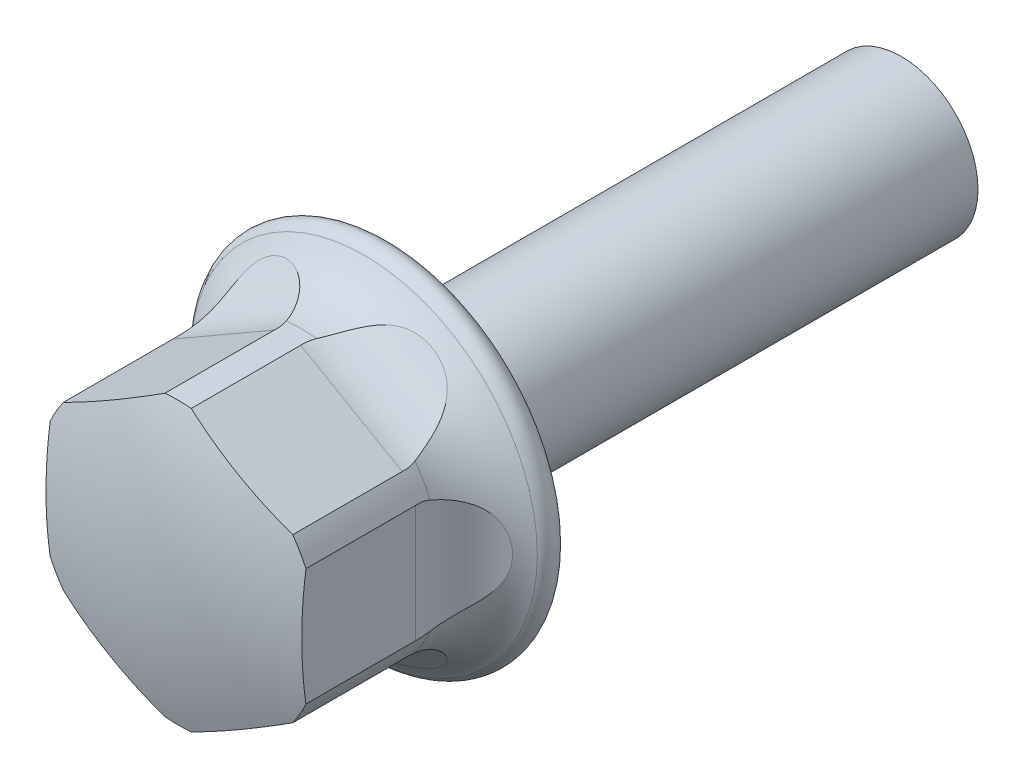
ISO-10303-21;
HEADER;
FILE_DESCRIPTION(('STEP AP214'),'2;1');
FILE_NAME('part.step','',(''),(''),'','','');
FILE_SCHEMA(('AUTOMOTIVE_DESIGN { 1 0 10303 214 1 1 1 1 }'));
ENDSEC;
DATA;
#1=APPLICATION_CONTEXT('core data for automotive mechanical design processes');
#2=APPLICATION_PROTOCOL_DEFINITION('international standard','automotive_design',2000,#1);
#3=PRODUCT_CONTEXT('',#1,'mechanical');
#4=PRODUCT('Part','Part','',(#3));
#5=PRODUCT_RELATED_PRODUCT_CATEGORY('part','',(#4));
#6=PRODUCT_DEFINITION_FORMATION('','',#4);
#7=PRODUCT_DEFINITION_CONTEXT('part definition',#1,'design');
#8=PRODUCT_DEFINITION('design','',#6,#7);
#9=PRODUCT_DEFINITION_SHAPE('','',#8);
#10=(LENGTH_UNIT() NAMED_UNIT(*) SI_UNIT(.MILLI.,.METRE.));
#11=(NAMED_UNIT(*) PLANE_ANGLE_UNIT() SI_UNIT($,.RADIAN.));
#12=(NAMED_UNIT(*) SI_UNIT($,.STERADIAN.) SOLID_ANGLE_UNIT());
#13=UNCERTAINTY_MEASURE_WITH_UNIT(LENGTH_MEASURE(1.E-05),#10,'distance_accuracy_value','');
#14=(GEOMETRIC_REPRESENTATION_CONTEXT(3) GLOBAL_UNCERTAINTY_ASSIGNED_CONTEXT((#13)) GLOBAL_UNIT_ASSIGNED_CONTEXT((#10,
#11,#12)) REPRESENTATION_CONTEXT('',''));
#15=CARTESIAN_POINT('',(0.,0.,0.));
#16=DIRECTION('',(0.,0.,1.));
#17=DIRECTION('',(1.,0.,0.));
#18=AXIS2_PLACEMENT_3D('',#15,#16,#17);
#19=CARTESIAN_POINT('',(0.,0.,0.));
#20=DIRECTION('',(0.,0.,1.));
#21=DIRECTION('',(1.,0.,0.));
#22=AXIS2_PLACEMENT_3D('',#19,#20,#21);
#23=CYLINDRICAL_SURFACE('',#22,5.5);
#24=DIRECTION('',(0.,0.,-1.));
#25=VECTOR('',#24,1.);
#26=CARTESIAN_POINT('',(0.515686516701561,5.47577094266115,14.));
#27=LINE('',#26,#25);
#28=CARTESIAN_POINT('',(0.515686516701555,5.47577094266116,8.27767862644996));
#29=VERTEX_POINT('',#28);
#30=CARTESIAN_POINT('',(0.515686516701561,5.47577094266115,4.));
#31=VERTEX_POINT('',#30);
#32=EDGE_CURVE('E181',#29,#31,#27,.T.);
#33=ORIENTED_EDGE('',*,*,#32,.T.);
#34=CARTESIAN_POINT('',(4.48662747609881,3.18122207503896,3.9));
#35=CARTESIAN_POINT('',(4.48662338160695,3.18123162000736,3.97230895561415));
#36=CARTESIAN_POINT('',(4.48298582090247,3.18637779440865,4.04473759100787));
#37=CARTESIAN_POINT('',(4.46852038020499,3.20662906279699,4.18756027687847));
#38=CARTESIAN_POINT('',(4.4576739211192,3.2217598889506,4.25794857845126));
#39=CARTESIAN_POINT('',(4.42916215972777,3.26084333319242,4.39440914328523));
#40=CARTESIAN_POINT('',(4.41152735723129,3.28475647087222,4.4604991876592));
#41=CARTESIAN_POINT('',(4.36991497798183,3.33991488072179,4.58732240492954));
#42=CARTESIAN_POINT('',(4.34593950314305,3.37115772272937,4.64805734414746));
#43=CARTESIAN_POINT('',(4.2895068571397,3.44273124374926,4.76917083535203));
#44=CARTESIAN_POINT('',(4.25644287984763,3.48365703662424,4.82891182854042));
#45=CARTESIAN_POINT('',(4.18406045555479,3.5702711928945,4.94062349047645));
#46=CARTESIAN_POINT('',(4.14473720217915,3.6159632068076,4.99258812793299));
#47=CARTESIAN_POINT('',(4.03842174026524,3.73502100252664,5.11410395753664));
#48=CARTESIAN_POINT('',(3.96774521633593,3.81031656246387,5.1785560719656));
#49=CARTESIAN_POINT('',(3.81572313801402,3.96256067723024,5.29096292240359));
#50=CARTESIAN_POINT('',(3.73435315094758,4.03951266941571,5.3388789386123));
#51=CARTESIAN_POINT('',(3.59327668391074,4.16459845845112,5.40552940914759));
#52=CARTESIAN_POINT('',(3.53606064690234,4.21331743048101,5.42859441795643));
#53=CARTESIAN_POINT('',(3.4184250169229,4.3093071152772,5.46892892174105));
#54=CARTESIAN_POINT('',(3.35800450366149,4.35657740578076,5.48619674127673));
#55=CARTESIAN_POINT('',(3.2343751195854,4.44913272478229,5.51526793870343));
#56=CARTESIAN_POINT('',(3.17116552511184,4.49441723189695,5.52706988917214));
#57=CARTESIAN_POINT('',(3.0423533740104,4.58259675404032,5.54544354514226));
#58=CARTESIAN_POINT('',(2.97674990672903,4.62549084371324,5.55201323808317));
#59=CARTESIAN_POINT('',(2.77526731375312,4.75111190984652,5.5642013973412));
#60=CARTESIAN_POINT('',(2.63619475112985,4.82966607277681,5.5619617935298));
#61=CARTESIAN_POINT('',(2.35332094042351,4.97363608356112,5.53650211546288));
#62=CARTESIAN_POINT('',(2.20952175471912,5.03905757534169,5.51329107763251));
#63=CARTESIAN_POINT('',(1.94344050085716,5.14688605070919,5.44918857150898));
#64=CARTESIAN_POINT('',(1.8211947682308,5.19127753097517,5.41150356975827));
#65=CARTESIAN_POINT('',(1.58051047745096,5.26952557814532,5.31751550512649));
#66=CARTESIAN_POINT('',(1.46206668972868,5.30339722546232,5.26123933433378));
#67=CARTESIAN_POINT('',(1.263468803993,5.3536329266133,5.14456984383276));
#68=CARTESIAN_POINT('',(1.18118519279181,5.37225786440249,5.08878452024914));
#69=CARTESIAN_POINT('',(1.02542147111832,5.40414631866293,4.96473804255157));
#70=CARTESIAN_POINT('',(0.951929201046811,5.41741730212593,4.89649445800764));
#71=CARTESIAN_POINT('',(0.830491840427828,5.43721886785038,4.7615848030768));
#72=CARTESIAN_POINT('',(0.780340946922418,5.44454721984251,4.69702899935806));
#73=CARTESIAN_POINT('',(0.691060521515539,5.45659848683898,4.56041936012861));
#74=CARTESIAN_POINT('',(0.651926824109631,5.46132238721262,4.4883683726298));
#75=CARTESIAN_POINT('',(0.586847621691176,5.46870222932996,4.33778515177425));
#76=CARTESIAN_POINT('',(0.560994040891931,5.4713438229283,4.25921200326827));
#77=CARTESIAN_POINT('',(0.524778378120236,5.47493857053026,4.09852834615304));
#78=CARTESIAN_POINT('',(0.51440681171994,5.4758927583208,4.0164200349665));
#79=CARTESIAN_POINT('',(0.510192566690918,5.47628504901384,3.86147128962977));
#80=CARTESIAN_POINT('',(0.514551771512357,5.47588804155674,3.7886748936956));
#81=CARTESIAN_POINT('',(0.535646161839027,5.47386466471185,3.64493536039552));
#82=CARTESIAN_POINT('',(0.552379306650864,5.47223849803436,3.57399191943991));
#83=CARTESIAN_POINT('',(0.596800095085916,5.4675689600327,3.43721711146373));
#84=CARTESIAN_POINT('',(0.624271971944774,5.46455330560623,3.37131389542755));
#85=CARTESIAN_POINT('',(0.688759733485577,5.45679952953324,3.24449826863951));
#86=CARTESIAN_POINT('',(0.725777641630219,5.45206104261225,3.18358691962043));
#87=CARTESIAN_POINT('',(0.811879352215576,5.43993723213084,3.0617526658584));
#88=CARTESIAN_POINT('',(0.861803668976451,5.43233310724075,3.00144855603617));
#89=CARTESIAN_POINT('',(0.969092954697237,5.41422476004,2.88840167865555));
#90=CARTESIAN_POINT('',(1.02646285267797,5.40371861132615,2.83566396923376));
#91=CARTESIAN_POINT('',(1.17749954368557,5.37327059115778,2.71266149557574));
#92=CARTESIAN_POINT('',(1.27471038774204,5.3512517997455,2.64724902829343));
#93=CARTESIAN_POINT('',(1.47629007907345,5.29919404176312,2.53248021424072));
#94=CARTESIAN_POINT('',(1.58067500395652,5.26913659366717,2.48316145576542));
#95=CARTESIAN_POINT('',(1.75548646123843,5.21282437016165,2.41374986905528));
#96=CARTESIAN_POINT('',(1.82505409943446,5.18890180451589,2.389463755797));
#97=CARTESIAN_POINT('',(1.96470986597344,5.1376508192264,2.34662742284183));
#98=CARTESIAN_POINT('',(2.03479814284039,5.11032138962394,2.32807890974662));
#99=CARTESIAN_POINT('',(2.24483567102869,5.02330517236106,2.28050091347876));
#100=CARTESIAN_POINT('',(2.38460423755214,4.95857567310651,2.25952132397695));
#101=CARTESIAN_POINT('',(2.66124038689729,4.81585315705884,2.23721912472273));
#102=CARTESIAN_POINT('',(2.79803784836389,4.73768361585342,2.23618206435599));
#103=CARTESIAN_POINT('',(3.06347416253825,4.57052120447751,2.25439226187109));
#104=CARTESIAN_POINT('',(3.19211517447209,4.48153121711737,2.27363412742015));
#105=CARTESIAN_POINT('',(3.42390208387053,4.30645056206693,2.33050687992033));
#106=CARTESIAN_POINT('',(3.52827617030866,4.22121381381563,2.36575502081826));
#107=CARTESIAN_POINT('',(3.72583449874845,4.04787795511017,2.45550119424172));
#108=CARTESIAN_POINT('',(3.81903362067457,3.95978285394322,2.50997323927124));
#109=CARTESIAN_POINT('',(3.96930066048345,3.80827952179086,2.62393742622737));
#110=CARTESIAN_POINT('',(4.02950692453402,3.74433073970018,2.67856506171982));
#111=CARTESIAN_POINT('',(4.14072736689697,3.62094398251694,2.80075843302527));
#112=CARTESIAN_POINT('',(4.19175605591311,3.56149897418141,2.86830338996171));
#113=CARTESIAN_POINT('',(4.27422459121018,3.46184430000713,3.00211864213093));
#114=CARTESIAN_POINT('',(4.30754425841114,3.42013813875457,3.06610794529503));
#115=CARTESIAN_POINT('',(4.36635045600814,3.34473809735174,3.20206320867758));
#116=CARTESIAN_POINT('',(4.39183476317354,3.31104649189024,3.27403142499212));
#117=CARTESIAN_POINT('',(4.43430755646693,3.25395252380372,3.42507769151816));
#118=CARTESIAN_POINT('',(4.45122265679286,3.23063923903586,3.5042105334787));
#119=CARTESIAN_POINT('',(4.47554685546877,3.19686306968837,3.66642758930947));
#120=CARTESIAN_POINT('',(4.48298909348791,3.18635539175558,3.74949696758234));
#121=CARTESIAN_POINT('',(4.48628127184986,3.18170917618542,3.85520785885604));
#122=CARTESIAN_POINT('',(4.48662874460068,3.1812191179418,3.8775981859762));
#123=CARTESIAN_POINT('',(4.48662747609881,3.18122207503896,3.9));
#124=B_SPLINE_CURVE_WITH_KNOTS('',3,(#34,#35,#36,#37,#38,#39,#40,#41,#42,#43,#44,#45,#46,#47,
#48,#49,#50,#51,#52,#53,#54,#55,#56,#57,#58,#59,#60,#61,#62,#63,#64,#65,#66,#67,#68,#69,#70,#71,
#72,#73,#74,#75,#76,#77,#78,#79,#80,#81,#82,#83,#84,#85,#86,#87,#88,#89,#90,#91,#92,#93,#94,#95,
#96,#97,#98,#99,#100,#101,#102,#103,#104,#105,#106,#107,#108,#109,#110,#111,#112,#113,#114,#115,
#116,#117,#118,#119,#120,#121,#122,#123),.UNSPECIFIED.,.T.,.F.,(4,2,2,2,2,2,2,2,2,2,2,2,2,2,2,2,
2,2,2,2,2,2,2,2,2,2,2,2,2,2,2,2,2,2,2,2,2,2,2,2,2,2,2,2,4),(0.,0.216867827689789,
0.434296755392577,0.650759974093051,0.867151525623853,1.10508806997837,1.34320821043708,
1.70640107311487,2.07043868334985,2.30598904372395,2.5416074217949,2.77728729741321,
3.0130577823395,3.49017853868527,3.96709380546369,4.37185029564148,4.77602385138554,
5.07838658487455,5.3803261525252,5.62556584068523,5.87071268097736,6.1175342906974,
6.36420463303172,6.5819058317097,6.79957113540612,7.01307093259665,7.22661602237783,
7.46170492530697,7.69695026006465,8.05264942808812,8.40917351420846,8.641305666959,
8.87350679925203,9.3377550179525,9.80864575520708,10.2794113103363,10.6957596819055,
11.1115473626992,11.4207736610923,11.7295066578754,11.9785171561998,12.227598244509,
12.4787778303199,12.7290762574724,12.7962634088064),.UNSPECIFIED.);
#125=CARTESIAN_POINT('',(0.594175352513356,5.46781086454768,3.44949995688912));
#126=VERTEX_POINT('',#125);
#127=EDGE_CURVE('E664',#31,#126,#124,.T.);
#128=ORIENTED_EDGE('',*,*,#127,.T.);
#129=CARTESIAN_POINT('',(0.,0.,3.44949995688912));
#130=DIRECTION('',(0.,0.,1.));
#131=DIRECTION('',(1.,0.,0.));
#132=AXIS2_PLACEMENT_3D('',#129,#130,#131);
#133=CIRCLE('',#132,5.5);
#134=CARTESIAN_POINT('',(-0.594175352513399,5.46781086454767,3.44949995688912));
#135=VERTEX_POINT('',#134);
#136=EDGE_CURVE('E164',#135,#126,#133,.F.);
#137=ORIENTED_EDGE('',*,*,#136,.F.);
#138=CARTESIAN_POINT('',(-0.511705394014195,5.47614440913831,3.9));
#139=CARTESIAN_POINT('',(-0.511715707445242,5.47614563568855,3.97230895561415));
#140=CARTESIAN_POINT('',(-0.517991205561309,5.47556850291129,4.04473759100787));
#141=CARTESIAN_POINT('',(-0.542762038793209,5.47316669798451,4.18756027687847));
#142=CARTESIAN_POINT('',(-0.561288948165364,5.47133880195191,4.25794857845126));
#143=CARTESIAN_POINT('',(-0.609392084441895,5.4661886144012,4.39440914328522));
#144=CARTESIAN_POINT('',(-0.638918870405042,5.46287299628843,4.46049918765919));
#145=CARTESIAN_POINT('',(-0.707493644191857,5.45441482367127,4.58732240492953));
#146=CARTESIAN_POINT('',(-0.746538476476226,5.44927287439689,4.64805734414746));
#147=CARTESIAN_POINT('',(-0.836739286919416,5.43618752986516,4.76917083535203));
#148=CARTESIAN_POINT('',(-0.888714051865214,5.42801618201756,4.82891182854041));
#149=CARTESIAN_POINT('',(-0.999915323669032,5.40863824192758,4.94062349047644));
#150=CARTESIAN_POINT('',(-1.05914739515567,5.39742931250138,4.99258812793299));
#151=CARTESIAN_POINT('',(-1.21541220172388,5.36488631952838,5.11410395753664));
#152=CARTESIAN_POINT('',(-1.31595833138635,5.34132643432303,5.17855607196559));
#153=CARTESIAN_POINT('',(-1.52381664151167,5.28579350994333,5.29096292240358));
#154=CARTESIAN_POINT('',(-1.63114401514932,5.25380103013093,5.3388789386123));
#155=CARTESIAN_POINT('',(-1.81000971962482,5.19416812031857,5.40552940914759));
#156=CARTESIAN_POINT('',(-1.88080960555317,5.16897706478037,5.42859441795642));
#157=CARTESIAN_POINT('',(-2.02275692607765,5.11509646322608,5.46892892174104));
#158=CARTESIAN_POINT('',(-2.09390445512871,5.08640590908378,5.48619674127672));
#159=CARTESIAN_POINT('',(-2.23587440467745,5.02561738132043,5.51526793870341));
#160=CARTESIAN_POINT('',(-2.30669673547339,4.99351852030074,5.52706988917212));
#161=CARTESIAN_POINT('',(-2.44746851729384,4.92605368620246,5.54544354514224));
#162=CARTESIAN_POINT('',(-2.51741762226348,4.89068646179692,5.55201323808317));
#163=CARTESIAN_POINT('',(-2.72694995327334,4.77900795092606,5.56420139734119));
#164=CARTESIAN_POINT('',(-2.86451613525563,4.69784466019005,5.56196179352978));
#165=CARTESIAN_POINT('',(-3.13063472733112,4.5248537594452,5.53650211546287));
#166=CARTESIAN_POINT('',(-3.25919099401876,4.43303075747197,5.51329107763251));
#167=CARTESIAN_POINT('',(-3.48561381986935,4.25651186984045,5.44918857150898));
#168=CARTESIAN_POINT('',(-3.58518083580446,4.17283970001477,5.41150356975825));
#169=CARTESIAN_POINT('',(-3.77328777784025,4.00352501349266,5.31751550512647));
#170=CARTESIAN_POINT('',(-3.86184337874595,3.91788550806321,5.26123933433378));
#171=CARTESIAN_POINT('',(-4.00464771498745,3.77101254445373,5.14456984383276));
#172=CARTESIAN_POINT('',(-4.06191918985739,3.70906531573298,5.08878452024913));
#173=CARTESIAN_POINT('',(-4.16741726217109,3.59011420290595,4.96473804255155));
#174=CARTESIAN_POINT('',(-4.21565640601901,3.53310352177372,4.89649445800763));
#175=CARTESIAN_POINT('',(-4.29352374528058,3.43783646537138,4.76158480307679));
#176=CARTESIAN_POINT('',(-4.32494573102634,3.39806869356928,4.69702899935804));
#177=CARTESIAN_POINT('',(-4.38002264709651,3.32677521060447,4.5604193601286));
#178=CARTESIAN_POINT('',(-4.40368051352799,3.29524638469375,4.48836837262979));
#179=CARTESIAN_POINT('',(-4.44261124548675,3.24257606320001,4.33778515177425));
#180=CARTESIAN_POINT('',(-4.457825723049,3.22150700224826,4.25921200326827));
#181=CARTESIAN_POINT('',(-4.47904669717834,3.19194069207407,4.09852834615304));
#182=CARTESIAN_POINT('',(-4.48505883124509,3.18343574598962,4.01642003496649));
#183=CARTESIAN_POINT('',(-4.48750568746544,3.17998224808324,3.86147128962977));
#184=CARTESIAN_POINT('',(-4.48498226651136,3.18355892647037,3.7886748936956));
#185=CARTESIAN_POINT('',(-4.47268277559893,3.20081551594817,3.64493536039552));
#186=CARTESIAN_POINT('',(-4.46290790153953,3.21449376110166,3.57399191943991));
#187=CARTESIAN_POINT('',(-4.43665356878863,3.25062852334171,3.43721711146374));
#188=CARTESIAN_POINT('',(-4.42030599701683,3.27291203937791,3.37131389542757));
#189=CARTESIAN_POINT('',(-4.38134714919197,3.32488319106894,3.24449826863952));
#190=CARTESIAN_POINT('',(-4.35873454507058,3.35457239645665,3.18358691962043));
#191=CARTESIAN_POINT('',(-4.30518416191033,3.42307675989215,3.0617526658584));
#192=CARTESIAN_POINT('',(-4.27363663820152,3.46251042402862,3.00144855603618));
#193=CARTESIAN_POINT('',(-4.20430970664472,3.54637149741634,2.88840167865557));
#194=CARTESIAN_POINT('',(-4.16652616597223,3.59080221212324,2.83566396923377));
#195=CARTESIAN_POINT('',(-4.06463906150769,3.70637981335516,2.71266149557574));
#196=CARTESIAN_POINT('',(-3.99696480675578,3.77955747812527,2.64724902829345));
#197=CARTESIAN_POINT('',(-3.85109162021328,3.92810173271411,2.53248021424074));
#198=CARTESIAN_POINT('',(-3.77286864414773,4.00347300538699,2.48316145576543));
#199=CARTESIAN_POINT('',(-3.6366950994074,4.12670805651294,2.41374986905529));
#200=CARTESIAN_POINT('',(-3.58119373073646,4.17499411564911,2.38946375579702));
#201=CARTESIAN_POINT('',(-3.46698119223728,4.27031406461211,2.34662742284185));
#202=CARTESIAN_POINT('',(-3.40826907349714,4.31734757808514,2.32807890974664));
#203=CARTESIAN_POINT('',(-3.22789205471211,4.45573730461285,2.28050091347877));
#204=CARTESIAN_POINT('',(-3.1019503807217,4.54441568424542,2.25952132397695));
#205=CARTESIAN_POINT('',(-2.84003098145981,4.71262835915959,2.23721912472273));
#206=CARTESIAN_POINT('',(-2.70393544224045,4.79201366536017,2.23618206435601));
#207=CARTESIAN_POINT('',(-2.42645039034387,4.93830705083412,2.25439226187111));
#208=CARTESIAN_POINT('',(-2.28506229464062,5.0052184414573,2.27363412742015));
#209=CARTESIAN_POINT('',(-2.01754454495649,5.11841146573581,2.33050687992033));
#210=CARTESIAN_POINT('',(-1.89154031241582,5.16618370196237,2.36575502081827));
#211=CARTESIAN_POINT('',(-1.64264789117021,5.25060630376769,2.45550119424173));
#212=CARTESIAN_POINT('',(-1.51975573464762,5.28727156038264,2.50997323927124));
#213=CARTESIAN_POINT('',(-1.31341648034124,5.34165496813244,2.62393742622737));
#214=CARTESIAN_POINT('',(-1.22793207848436,5.36182073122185,2.67856506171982));
#215=CARTESIAN_POINT('',(-1.0654657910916,5.39644708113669,2.80075843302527));
#216=CARTESIAN_POINT('',(-0.988470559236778,5.41091671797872,2.8683033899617));
#217=CARTESIAN_POINT('',(-0.860932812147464,5.43250922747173,3.00211864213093));
#218=CARTESIAN_POINT('',(-0.808154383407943,5.44051182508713,3.06610794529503));
#219=CARTESIAN_POINT('',(-0.713452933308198,5.45373946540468,3.20206320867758));
#220=CARTESIAN_POINT('',(-0.671532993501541,5.45896372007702,3.27403142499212));
#221=CARTESIAN_POINT('',(-0.600851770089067,5.46719925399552,3.42507769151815));
#222=CARTESIAN_POINT('',(-0.572204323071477,5.47019151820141,3.5042105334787));
#223=CARTESIAN_POINT('',(-0.53079120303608,5.4743688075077,3.66642758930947));
#224=CARTESIAN_POINT('',(-0.517970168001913,5.47556013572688,3.74949696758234));
#225=CARTESIAN_POINT('',(-0.512300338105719,5.47608813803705,3.85520785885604));
#226=CARTESIAN_POINT('',(-0.511702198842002,5.47614402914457,3.8775981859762));
#227=CARTESIAN_POINT('',(-0.511705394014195,5.47614440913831,3.9));
#228=B_SPLINE_CURVE_WITH_KNOTS('',3,(#138,#139,#140,#141,#142,#143,#144,#145,#146,#147,#148,
#149,#150,#151,#152,#153,#154,#155,#156,#157,#158,#159,#160,#161,#162,#163,#164,#165,#166,#167,
#168,#169,#170,#171,#172,#173,#174,#175,#176,#177,#178,#179,#180,#181,#182,#183,#184,#185,#186,
#187,#188,#189,#190,#191,#192,#193,#194,#195,#196,#197,#198,#199,#200,#201,#202,#203,#204,#205,
#206,#207,#208,#209,#210,#211,#212,#213,#214,#215,#216,#217,#218,#219,#220,#221,#222,#223,#224,
#225,#226,#227),.UNSPECIFIED.,.T.,.F.,(4,2,2,2,2,2,2,2,2,2,2,2,2,2,2,2,2,2,2,2,2,2,2,2,2,2,2,2,
2,2,2,2,2,2,2,2,2,2,2,2,2,2,2,2,4),(0.,0.216867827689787,0.434296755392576,0.650759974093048,
0.867151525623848,1.10508806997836,1.34320821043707,1.70640107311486,2.07043868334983,
2.30598904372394,2.54160742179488,2.77728729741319,3.01305778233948,3.49017853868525,
3.96709380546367,4.37185029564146,4.77602385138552,5.07838658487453,5.38032615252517,
5.6255658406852,5.87071268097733,6.11753429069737,6.36420463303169,6.58190583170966,
6.79957113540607,7.0130709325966,7.22661602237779,7.46170492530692,7.6969502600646,
8.05264942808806,8.4091735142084,8.64130566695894,8.87350679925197,9.33775501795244,
9.80864575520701,10.2794113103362,10.6957596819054,11.1115473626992,11.4207736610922,
11.7295066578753,11.9785171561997,12.2275982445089,12.4787778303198,12.7290762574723,
12.7962634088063),.UNSPECIFIED.);
#229=CARTESIAN_POINT('',(-0.515686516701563,5.47577094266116,4.));
#230=VERTEX_POINT('',#229);
#231=EDGE_CURVE('E146',#135,#230,#228,.T.);
#232=ORIENTED_EDGE('',*,*,#231,.T.);
#233=DIRECTION('',(0.,0.,-1.));
#234=VECTOR('',#233,1.);
#235=CARTESIAN_POINT('',(-0.515686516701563,5.47577094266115,14.));
#236=LINE('',#235,#234);
#237=CARTESIAN_POINT('',(-0.515686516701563,5.47577094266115,8.27767862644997));
#238=VERTEX_POINT('',#237);
#239=EDGE_CURVE('E154',#238,#230,#236,.T.);
#240=ORIENTED_EDGE('',*,*,#239,.F.);
#241=CARTESIAN_POINT('',(0.,0.,8.27767862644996));
#242=DIRECTION('',(0.,0.,1.));
#243=DIRECTION('',(1.,0.,0.));
#244=AXIS2_PLACEMENT_3D('',#241,#242,#243);
#245=CIRCLE('',#244,5.5);
#246=EDGE_CURVE('E225',#29,#238,#245,.T.);
#247=ORIENTED_EDGE('',*,*,#246,.F.);
#248=EDGE_LOOP('',(#33,#128,#137,#232,#240,#247));
#249=FACE_BOUND('',#248,.T.);
#250=ADVANCED_FACE('F16',(#249),#23,.T.);
#251=DIRECTION('',(0.,0.,-1.));
#252=VECTOR('',#251,1.);
#253=CARTESIAN_POINT('',(4.48431348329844,-3.18448309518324,14.));
#254=LINE('',#253,#252);
#255=CARTESIAN_POINT('',(4.48431348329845,-3.18448309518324,8.27767862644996));
#256=VERTEX_POINT('',#255);
#257=CARTESIAN_POINT('',(4.48431348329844,-3.18448309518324,4.));
#258=VERTEX_POINT('',#257);
#259=EDGE_CURVE('E32',#256,#258,#254,.T.);
#260=ORIENTED_EDGE('',*,*,#259,.T.);
#261=CARTESIAN_POINT('',(0.511705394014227,-5.47614440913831,3.9));
#262=CARTESIAN_POINT('',(0.511715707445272,-5.47614563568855,3.97230895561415));
#263=CARTESIAN_POINT('',(0.517991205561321,-5.47556850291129,4.04473759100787));
#264=CARTESIAN_POINT('',(0.542762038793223,-5.47316669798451,4.18756027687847));
#265=CARTESIAN_POINT('',(0.561288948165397,-5.47133880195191,4.25794857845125));
#266=CARTESIAN_POINT('',(0.609392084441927,-5.4661886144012,4.39440914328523));
#267=CARTESIAN_POINT('',(0.638918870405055,-5.46287299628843,4.46049918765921));
#268=CARTESIAN_POINT('',(0.707493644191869,-5.45441482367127,4.58732240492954));
#269=CARTESIAN_POINT('',(0.746538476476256,-5.44927287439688,4.64805734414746));
#270=CARTESIAN_POINT('',(0.836739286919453,-5.43618752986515,4.76917083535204));
#271=CARTESIAN_POINT('',(0.888714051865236,-5.42801618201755,4.82891182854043));
#272=CARTESIAN_POINT('',(0.99991532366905,-5.40863824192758,4.94062349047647));
#273=CARTESIAN_POINT('',(1.0591473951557,-5.39742931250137,4.992588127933));
#274=CARTESIAN_POINT('',(1.21541220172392,-5.36488631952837,5.11410395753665));
#275=CARTESIAN_POINT('',(1.31595833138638,-5.34132643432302,5.17855607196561));
#276=CARTESIAN_POINT('',(1.5238166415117,-5.28579350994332,5.2909629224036));
#277=CARTESIAN_POINT('',(1.63114401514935,-5.25380103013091,5.33887893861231));
#278=CARTESIAN_POINT('',(1.81000971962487,-5.19416812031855,5.40552940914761));
#279=CARTESIAN_POINT('',(1.88080960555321,-5.16897706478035,5.42859441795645));
#280=CARTESIAN_POINT('',(2.02275692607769,-5.11509646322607,5.46892892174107));
#281=CARTESIAN_POINT('',(2.09390445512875,-5.08640590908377,5.48619674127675));
#282=CARTESIAN_POINT('',(2.23587440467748,-5.02561738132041,5.51526793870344));
#283=CARTESIAN_POINT('',(2.30669673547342,-4.99351852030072,5.52706988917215));
#284=CARTESIAN_POINT('',(2.44746851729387,-4.92605368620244,5.54544354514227));
#285=CARTESIAN_POINT('',(2.51741762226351,-4.8906864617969,5.55201323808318));
#286=CARTESIAN_POINT('',(2.72694995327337,-4.77900795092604,5.5642013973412));
#287=CARTESIAN_POINT('',(2.86451613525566,-4.69784466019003,5.56196179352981));
#288=CARTESIAN_POINT('',(3.13063472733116,-4.52485375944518,5.53650211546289));
#289=CARTESIAN_POINT('',(3.2591909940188,-4.43303075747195,5.51329107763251));
#290=CARTESIAN_POINT('',(3.48561381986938,-4.25651186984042,5.44918857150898));
#291=CARTESIAN_POINT('',(3.5851808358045,-4.17283970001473,5.41150356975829));
#292=CARTESIAN_POINT('',(3.77328777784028,-4.00352501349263,5.3175155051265));
#293=CARTESIAN_POINT('',(3.86184337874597,-3.91788550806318,5.26123933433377));
#294=CARTESIAN_POINT('',(4.00464771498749,-3.77101254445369,5.14456984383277));
#295=CARTESIAN_POINT('',(4.06191918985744,-3.70906531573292,5.08878452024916));
#296=CARTESIAN_POINT('',(4.16741726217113,-3.5901142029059,4.96473804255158));
#297=CARTESIAN_POINT('',(4.21565640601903,-3.53310352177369,4.89649445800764));
#298=CARTESIAN_POINT('',(4.29352374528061,-3.43783646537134,4.76158480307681));
#299=CARTESIAN_POINT('',(4.32494573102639,-3.39806869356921,4.69702899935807));
#300=CARTESIAN_POINT('',(4.38002264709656,-3.32677521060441,4.56041936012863));
#301=CARTESIAN_POINT('',(4.40368051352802,-3.29524638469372,4.4883683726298));
#302=CARTESIAN_POINT('',(4.44261124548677,-3.24257606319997,4.33778515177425));
#303=CARTESIAN_POINT('',(4.45782572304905,-3.22150700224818,4.25921200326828));
#304=CARTESIAN_POINT('',(4.47904669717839,-3.19194069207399,4.09852834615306));
#305=CARTESIAN_POINT('',(4.48505883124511,-3.18343574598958,4.01642003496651));
#306=CARTESIAN_POINT('',(4.48750568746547,-3.17998224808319,3.86147128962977));
#307=CARTESIAN_POINT('',(4.48498226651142,-3.18355892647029,3.7886748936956));
#308=CARTESIAN_POINT('',(4.47268277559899,-3.20081551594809,3.64493536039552));
#309=CARTESIAN_POINT('',(4.46290790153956,-3.21449376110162,3.57399191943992));
#310=CARTESIAN_POINT('',(4.43665356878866,-3.25062852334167,3.43721711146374));
#311=CARTESIAN_POINT('',(4.42030599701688,-3.27291203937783,3.37131389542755));
#312=CARTESIAN_POINT('',(4.38134714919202,-3.32488319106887,3.24449826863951));
#313=CARTESIAN_POINT('',(4.35873454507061,-3.35457239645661,3.18358691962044));
#314=CARTESIAN_POINT('',(4.30518416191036,-3.42307675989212,3.0617526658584));
#315=CARTESIAN_POINT('',(4.27363663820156,-3.46251042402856,3.00144855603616));
#316=CARTESIAN_POINT('',(4.20430970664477,-3.54637149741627,2.88840167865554));
#317=CARTESIAN_POINT('',(4.16652616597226,-3.5908022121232,2.83566396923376));
#318=CARTESIAN_POINT('',(4.06463906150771,-3.70637981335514,2.71266149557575));
#319=CARTESIAN_POINT('',(3.99696480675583,-3.77955747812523,2.64724902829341));
#320=CARTESIAN_POINT('',(3.85109162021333,-3.92810173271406,2.5324802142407));
#321=CARTESIAN_POINT('',(3.77286864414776,-4.00347300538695,2.48316145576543));
#322=CARTESIAN_POINT('',(3.63669509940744,-4.12670805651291,2.41374986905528));
#323=CARTESIAN_POINT('',(3.5811937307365,-4.17499411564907,2.389463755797));
#324=CARTESIAN_POINT('',(3.46698119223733,-4.27031406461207,2.34662742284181));
#325=CARTESIAN_POINT('',(3.40826907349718,-4.3173475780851,2.3280789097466));
#326=CARTESIAN_POINT('',(3.22789205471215,-4.45573730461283,2.28050091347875));
#327=CARTESIAN_POINT('',(3.10195038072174,-4.5444156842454,2.25952132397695));
#328=CARTESIAN_POINT('',(2.84003098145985,-4.71262835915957,2.23721912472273));
#329=CARTESIAN_POINT('',(2.70393544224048,-4.79201366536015,2.23618206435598));
#330=CARTESIAN_POINT('',(2.4264503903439,-4.9383070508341,2.25439226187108));
#331=CARTESIAN_POINT('',(2.28506229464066,-5.00521844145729,2.27363412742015));
#332=CARTESIAN_POINT('',(2.01754454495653,-5.1184114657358,2.33050687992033));
#333=CARTESIAN_POINT('',(1.89154031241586,-5.16618370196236,2.36575502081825));
#334=CARTESIAN_POINT('',(1.64264789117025,-5.25060630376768,2.4555011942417));
#335=CARTESIAN_POINT('',(1.51975573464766,-5.28727156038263,2.50997323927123));
#336=CARTESIAN_POINT('',(1.31341648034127,-5.34165496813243,2.62393742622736));
#337=CARTESIAN_POINT('',(1.22793207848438,-5.36182073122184,2.6785650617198));
#338=CARTESIAN_POINT('',(1.06546579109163,-5.39644708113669,2.80075843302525));
#339=CARTESIAN_POINT('',(0.988470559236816,-5.41091671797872,2.8683033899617));
#340=CARTESIAN_POINT('',(0.860932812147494,-5.43250922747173,3.00211864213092));
#341=CARTESIAN_POINT('',(0.808154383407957,-5.44051182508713,3.06610794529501));
#342=CARTESIAN_POINT('',(0.713452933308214,-5.45373946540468,3.20206320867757));
#343=CARTESIAN_POINT('',(0.671532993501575,-5.45896372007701,3.27403142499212));
#344=CARTESIAN_POINT('',(0.6008517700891,-5.46719925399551,3.42507769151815));
#345=CARTESIAN_POINT('',(0.572204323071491,-5.47019151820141,3.5042105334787));
#346=CARTESIAN_POINT('',(0.530791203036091,-5.4743688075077,3.66642758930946));
#347=CARTESIAN_POINT('',(0.517970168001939,-5.47556013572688,3.74949696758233));
#348=CARTESIAN_POINT('',(0.512300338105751,-5.47608813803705,3.85520785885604));
#349=CARTESIAN_POINT('',(0.511702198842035,-5.47614402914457,3.8775981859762));
#350=CARTESIAN_POINT('',(0.511705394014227,-5.47614440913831,3.9));
#351=B_SPLINE_CURVE_WITH_KNOTS('',3,(#261,#262,#263,#264,#265,#266,#267,#268,#269,#270,#271,
#272,#273,#274,#275,#276,#277,#278,#279,#280,#281,#282,#283,#284,#285,#286,#287,#288,#289,#290,
#291,#292,#293,#294,#295,#296,#297,#298,#299,#300,#301,#302,#303,#304,#305,#306,#307,#308,#309,
#310,#311,#312,#313,#314,#315,#316,#317,#318,#319,#320,#321,#322,#323,#324,#325,#326,#327,#328,
#329,#330,#331,#332,#333,#334,#335,#336,#337,#338,#339,#340,#341,#342,#343,#344,#345,#346,#347,
#348,#349,#350),.UNSPECIFIED.,.T.,.F.,(4,2,2,2,2,2,2,2,2,2,2,2,2,2,2,2,2,2,2,2,2,2,2,2,2,2,2,2,
2,2,2,2,2,2,2,2,2,2,2,2,2,2,2,2,4),(0.,0.21686782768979,0.43429675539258,0.650759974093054,
0.867151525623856,1.10508806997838,1.34320821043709,1.70640107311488,2.07043868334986,
2.30598904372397,2.54160742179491,2.77728729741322,3.01305778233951,3.49017853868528,
3.9670938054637,4.3718502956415,4.77602385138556,5.07838658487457,5.38032615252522,
5.62556584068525,5.87071268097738,6.11753429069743,6.36420463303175,6.58190583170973,
6.79957113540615,7.01307093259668,7.22661602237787,7.461704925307,7.69695026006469,
8.05264942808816,8.40917351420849,8.64130566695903,8.87350679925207,9.33775501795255,
9.80864575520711,10.2794113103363,10.6957596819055,11.1115473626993,11.4207736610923,
11.7295066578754,11.9785171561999,12.227598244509,12.4787778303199,12.7290762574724,
12.7962634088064),.UNSPECIFIED.);
#352=CARTESIAN_POINT('',(4.4381754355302,-3.24847638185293,3.44949995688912));
#353=VERTEX_POINT('',#352);
#354=EDGE_CURVE('E425',#258,#353,#351,.T.);
#355=ORIENTED_EDGE('',*,*,#354,.T.);
#356=CARTESIAN_POINT('',(5.03235078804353,-2.21933448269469,3.44949995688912));
#357=VERTEX_POINT('',#356);
#358=EDGE_CURVE('E227',#357,#353,#133,.F.);
#359=ORIENTED_EDGE('',*,*,#358,.F.);
#360=CARTESIAN_POINT('',(5.03235078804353,-2.21933448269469,3.44949995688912));
#361=CARTESIAN_POINT('',(5.02725471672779,-2.23088694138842,3.48303900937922));
#362=CARTESIAN_POINT('',(5.0226694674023,-2.24117972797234,3.51707689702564));
#363=CARTESIAN_POINT('',(5.01461214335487,-2.25915113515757,3.58597203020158));
#364=CARTESIAN_POINT('',(5.01114031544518,-2.26682917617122,3.62082945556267));
#365=CARTESIAN_POINT('',(5.00254872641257,-2.28576264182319,3.72617734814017));
#366=CARTESIAN_POINT('',(4.99922832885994,-2.29297197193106,3.79760103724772));
#367=CARTESIAN_POINT('',(4.99775313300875,-2.29618499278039,3.94084733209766));
#368=CARTESIAN_POINT('',(4.99960739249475,-2.29216903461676,4.01267041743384));
#369=CARTESIAN_POINT('',(5.00830270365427,-2.27310593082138,4.15448872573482));
#370=CARTESIAN_POINT('',(5.0151416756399,-2.25806338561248,4.22448469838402));
#371=CARTESIAN_POINT('',(5.03308265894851,-2.21778154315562,4.36040059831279));
#372=CARTESIAN_POINT('',(5.04415875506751,-2.19260418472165,4.42634252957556));
#373=CARTESIAN_POINT('',(5.06960724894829,-2.13310237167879,4.55327211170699));
#374=CARTESIAN_POINT('',(5.08398148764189,-2.09877280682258,4.61425696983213));
#375=CARTESIAN_POINT('',(5.11646702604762,-2.01837003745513,4.73619546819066));
#376=CARTESIAN_POINT('',(5.13480821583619,-1.97146618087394,4.79653718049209));
#377=CARTESIAN_POINT('',(5.17271039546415,-1.86976540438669,4.90966452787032));
#378=CARTESIAN_POINT('',(5.19227200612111,-1.81496444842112,4.9624462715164));
#379=CARTESIAN_POINT('',(5.2413623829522,-1.66931640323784,5.08553623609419));
#380=CARTESIAN_POINT('',(5.27087371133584,-1.57436481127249,5.1510082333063));
#381=CARTESIAN_POINT('',(5.32656656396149,-1.37423821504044,5.26592976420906));
#382=CARTESIAN_POINT('',(5.35274001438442,-1.26903946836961,5.31534087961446));
#383=CARTESIAN_POINT('',(5.39142965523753,-1.08983513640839,5.38493257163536));
#384=CARTESIAN_POINT('',(5.40552580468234,-1.01774244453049,5.4092980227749));
#385=CARTESIAN_POINT('',(5.43103994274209,-0.871395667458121,5.45229764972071));
#386=CARTESIAN_POINT('',(5.44245713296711,-0.797140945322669,5.47093011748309));
#387=CARTESIAN_POINT('',(5.47225553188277,-0.572050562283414,5.5187669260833));
#388=CARTESIAN_POINT('',(5.48619457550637,-0.41883881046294,5.53992918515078));
#389=CARTESIAN_POINT('',(5.50117028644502,-0.108247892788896,5.56263104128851));
#390=CARTESIAN_POINT('',(5.50201810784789,0.04915951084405,5.56388343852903));
#391=CARTESIAN_POINT('',(5.49028127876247,0.36236718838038,5.54614939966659));
#392=CARTESIAN_POINT('',(5.47770001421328,0.518167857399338,5.52716806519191));
#393=CARTESIAN_POINT('',(5.442238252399,0.806688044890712,5.47077792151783));
#394=CARTESIAN_POINT('',(5.4206842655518,0.940024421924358,5.43569732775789));
#395=CARTESIAN_POINT('',(5.36944553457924,1.1984561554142,5.34624557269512));
#396=CARTESIAN_POINT('',(5.33977189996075,1.32356248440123,5.2919007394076));
#397=CARTESIAN_POINT('',(5.28369152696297,1.53002759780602,5.17813041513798));
#398=CARTESIAN_POINT('',(5.25840012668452,1.61437488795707,5.12358634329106));
#399=CARTESIAN_POINT('',(5.2070931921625,1.77287321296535,5.00152261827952));
#400=CARTESIAN_POINT('',(5.18107876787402,1.84703893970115,4.9340220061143));
#401=CARTESIAN_POINT('',(5.1359027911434,1.96872731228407,4.80025346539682));
#402=CARTESIAN_POINT('',(5.11638950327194,2.0186282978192,4.73627637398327));
#403=CARTESIAN_POINT('',(5.0803852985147,2.10760286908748,4.6003644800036));
#404=CARTESIAN_POINT('',(5.06389314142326,2.14668090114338,4.52843296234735));
#405=CARTESIAN_POINT('',(5.03557698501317,2.21229873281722,4.37749833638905));
#406=CARTESIAN_POINT('',(5.02378761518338,2.23874579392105,4.29844784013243));
#407=CARTESIAN_POINT('',(5.00653668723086,2.27707023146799,4.13619368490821));
#408=CARTESIAN_POINT('',(5.00107265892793,2.28895329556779,4.05299166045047));
#409=CARTESIAN_POINT('',(4.99743891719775,2.29686941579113,3.89617290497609));
#410=CARTESIAN_POINT('',(4.99844199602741,2.29469977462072,3.82265954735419));
#411=CARTESIAN_POINT('',(5.00573173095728,2.27875712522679,3.67727453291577));
#412=CARTESIAN_POINT('',(5.01200932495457,2.26500401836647,3.60540027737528));
#413=CARTESIAN_POINT('',(5.02411746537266,2.23792366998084,3.50640204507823));
#414=CARTESIAN_POINT('',(5.02805076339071,2.22907762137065,3.4777558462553));
#415=CARTESIAN_POINT('',(5.03235078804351,2.2193344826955,3.4494999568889));
#416=B_SPLINE_CURVE_WITH_KNOTS('',3,(#360,#361,#362,#363,#364,#365,#366,#367,#368,#369,#370,
#371,#372,#373,#374,#375,#376,#377,#378,#379,#380,#381,#382,#383,#384,#385,#386,#387,#388,#389,
#390,#391,#392,#393,#394,#395,#396,#397,#398,#399,#400,#401,#402,#403,#404,#405,#406,#407,#408,
#409,#410,#411,#412,#413,#414,#415),.UNSPECIFIED.,.F.,.F.,(4,2,2,2,2,2,2,2,2,2,2,2,2,2,2,2,2,2,
2,2,2,2,2,2,2,2,2,4),(0.,0.107455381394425,0.214934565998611,0.429393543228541,
0.644228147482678,0.858973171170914,1.07242523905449,1.28599674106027,1.52090717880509,
1.7559381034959,2.11113326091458,2.46717191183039,2.69907123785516,2.93103958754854,
3.39481532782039,3.86527506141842,4.33561620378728,4.75273555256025,5.16928701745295,
5.47895813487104,5.78817759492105,6.03753841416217,6.28679663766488,6.53785784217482,
6.78882096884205,7.00838009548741,7.2275627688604,7.31819287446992),.UNSPECIFIED.);
#417=CARTESIAN_POINT('',(5.,-2.29128784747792,4.));
#418=VERTEX_POINT('',#417);
#419=EDGE_CURVE('E437',#357,#418,#416,.T.);
#420=ORIENTED_EDGE('',*,*,#419,.T.);
#421=DIRECTION('',(0.,0.,-1.));
#422=VECTOR('',#421,1.);
#423=CARTESIAN_POINT('',(5.,-2.29128784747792,14.));
#424=LINE('',#423,#422);
#425=CARTESIAN_POINT('',(5.,-2.29128784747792,8.27767862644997));
#426=VERTEX_POINT('',#425);
#427=EDGE_CURVE('E495',#426,#418,#424,.T.);
#428=ORIENTED_EDGE('',*,*,#427,.F.);
#429=EDGE_CURVE('E226',#256,#426,#245,.T.);
#430=ORIENTED_EDGE('',*,*,#429,.F.);
#431=EDGE_LOOP('',(#260,#355,#359,#420,#428,#430));
#432=FACE_BOUND('',#431,.T.);
#433=ADVANCED_FACE('F275',(#432),#23,.T.);
#434=CARTESIAN_POINT('',(0.59417535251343,-5.46781086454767,3.44949995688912));
#435=VERTEX_POINT('',#434);
#436=CARTESIAN_POINT('',(-0.594175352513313,-5.46781086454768,3.44949995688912));
#437=VERTEX_POINT('',#436);
#438=EDGE_CURVE('E232',#435,#437,#133,.F.);
#439=ORIENTED_EDGE('',*,*,#438,.F.);
#440=CARTESIAN_POINT('',(0.51568651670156,-5.47577094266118,4.));
#441=VERTEX_POINT('',#440);
#442=EDGE_CURVE('E335',#435,#441,#351,.T.);
#443=ORIENTED_EDGE('',*,*,#442,.T.);
#444=DIRECTION('',(0.,0.,-1.));
#445=VECTOR('',#444,1.);
#446=CARTESIAN_POINT('',(0.51568651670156,-5.47577094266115,14.));
#447=LINE('',#446,#445);
#448=CARTESIAN_POINT('',(0.515686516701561,-5.47577094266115,8.27767862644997));
#449=VERTEX_POINT('',#448);
#450=EDGE_CURVE('E214',#449,#441,#447,.T.);
#451=ORIENTED_EDGE('',*,*,#450,.F.);
#452=CARTESIAN_POINT('',(-0.515686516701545,-5.47577094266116,8.27767862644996));
#453=VERTEX_POINT('',#452);
#454=EDGE_CURVE('E488',#453,#449,#245,.T.);
#455=ORIENTED_EDGE('',*,*,#454,.F.);
#456=DIRECTION('',(0.,0.,-1.));
#457=VECTOR('',#456,1.);
#458=CARTESIAN_POINT('',(-0.515686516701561,-5.47577094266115,14.));
#459=LINE('',#458,#457);
#460=CARTESIAN_POINT('',(-0.515686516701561,-5.47577094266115,4.));
#461=VERTEX_POINT('',#460);
#462=EDGE_CURVE('E40',#453,#461,#459,.T.);
#463=ORIENTED_EDGE('',*,*,#462,.T.);
#464=CARTESIAN_POINT('',(-4.48662747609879,-3.18122207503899,3.9));
#465=CARTESIAN_POINT('',(-4.48662338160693,-3.18123162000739,3.97230895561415));
#466=CARTESIAN_POINT('',(-4.48298582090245,-3.18637779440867,4.04473759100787));
#467=CARTESIAN_POINT('',(-4.46852038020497,-3.20662906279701,4.18756027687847));
#468=CARTESIAN_POINT('',(-4.45767392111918,-3.22175988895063,4.25794857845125));
#469=CARTESIAN_POINT('',(-4.42916215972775,-3.26084333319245,4.39440914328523));
#470=CARTESIAN_POINT('',(-4.41152735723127,-3.28475647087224,4.46049918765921));
#471=CARTESIAN_POINT('',(-4.36991497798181,-3.33991488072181,4.58732240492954));
#472=CARTESIAN_POINT('',(-4.34593950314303,-3.3711577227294,4.64805734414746));
#473=CARTESIAN_POINT('',(-4.28950685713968,-3.44273124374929,4.76917083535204));
#474=CARTESIAN_POINT('',(-4.25644287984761,-3.48365703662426,4.82891182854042));
#475=CARTESIAN_POINT('',(-4.18406045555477,-3.57027119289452,4.94062349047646));
#476=CARTESIAN_POINT('',(-4.14473720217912,-3.61596320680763,4.992588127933));
#477=CARTESIAN_POINT('',(-4.03842174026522,-3.73502100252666,5.11410395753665));
#478=CARTESIAN_POINT('',(-3.96774521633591,-3.81031656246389,5.17855607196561));
#479=CARTESIAN_POINT('',(-3.81572313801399,-3.96256067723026,5.2909629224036));
#480=CARTESIAN_POINT('',(-3.73435315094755,-4.03951266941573,5.3388789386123));
#481=CARTESIAN_POINT('',(-3.59327668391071,-4.16459845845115,5.4055294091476));
#482=CARTESIAN_POINT('',(-3.53606064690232,-4.21331743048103,5.42859441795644));
#483=CARTESIAN_POINT('',(-3.41842501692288,-4.30930711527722,5.46892892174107));
#484=CARTESIAN_POINT('',(-3.35800450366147,-4.35657740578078,5.48619674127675));
#485=CARTESIAN_POINT('',(-3.23437511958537,-4.4491327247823,5.51526793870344));
#486=CARTESIAN_POINT('',(-3.17116552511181,-4.49441723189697,5.52706988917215));
#487=CARTESIAN_POINT('',(-3.04235337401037,-4.58259675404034,5.54544354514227));
#488=CARTESIAN_POINT('',(-2.97674990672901,-4.62549084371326,5.55201323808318));
#489=CARTESIAN_POINT('',(-2.7752673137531,-4.75111190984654,5.5642013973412));
#490=CARTESIAN_POINT('',(-2.63619475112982,-4.82966607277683,5.56196179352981));
#491=CARTESIAN_POINT('',(-2.35332094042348,-4.97363608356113,5.53650211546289));
#492=CARTESIAN_POINT('',(-2.2095217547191,-5.0390575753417,5.51329107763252));
#493=CARTESIAN_POINT('',(-1.94344050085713,-5.1468860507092,5.44918857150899));
#494=CARTESIAN_POINT('',(-1.82119476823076,-5.19127753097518,5.41150356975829));
#495=CARTESIAN_POINT('',(-1.58051047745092,-5.26952557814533,5.3175155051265));
#496=CARTESIAN_POINT('',(-1.46206668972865,-5.30339722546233,5.26123933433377));
#497=CARTESIAN_POINT('',(-1.26346880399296,-5.35363292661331,5.14456984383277));
#498=CARTESIAN_POINT('',(-1.18118519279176,-5.3722578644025,5.08878452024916));
#499=CARTESIAN_POINT('',(-1.02542147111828,-5.40414631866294,4.96473804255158));
#500=CARTESIAN_POINT('',(-0.951929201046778,-5.41741730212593,4.89649445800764));
#501=CARTESIAN_POINT('',(-0.830491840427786,-5.43721886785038,4.76158480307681));
#502=CARTESIAN_POINT('',(-0.780340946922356,-5.44454721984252,4.69702899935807));
#503=CARTESIAN_POINT('',(-0.691060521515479,-5.45659848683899,4.56041936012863));
#504=CARTESIAN_POINT('',(-0.651926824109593,-5.46132238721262,4.4883683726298));
#505=CARTESIAN_POINT('',(-0.586847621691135,-5.46870222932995,4.33778515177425));
#506=CARTESIAN_POINT('',(-0.560994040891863,-5.47134382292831,4.25921200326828));
#507=CARTESIAN_POINT('',(-0.524778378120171,-5.47493857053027,4.09852834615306));
#508=CARTESIAN_POINT('',(-0.514406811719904,-5.4758927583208,4.01642003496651));
#509=CARTESIAN_POINT('',(-0.510192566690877,-5.47628504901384,3.86147128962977));
#510=CARTESIAN_POINT('',(-0.51455177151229,-5.47588804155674,3.7886748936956));
#511=CARTESIAN_POINT('',(-0.535646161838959,-5.47386466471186,3.64493536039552));
#512=CARTESIAN_POINT('',(-0.55237930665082,-5.47223849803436,3.57399191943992));
#513=CARTESIAN_POINT('',(-0.596800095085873,-5.4675689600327,3.43721711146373));
#514=CARTESIAN_POINT('',(-0.624271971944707,-5.46455330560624,3.37131389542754));
#515=CARTESIAN_POINT('',(-0.688759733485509,-5.45679952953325,3.24449826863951));
#516=CARTESIAN_POINT('',(-0.725777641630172,-5.45206104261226,3.18358691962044));
#517=CARTESIAN_POINT('',(-0.811879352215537,-5.43993723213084,3.0617526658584));
#518=CARTESIAN_POINT('',(-0.861803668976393,-5.43233310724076,3.00144855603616));
#519=CARTESIAN_POINT('',(-0.969092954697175,-5.41422476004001,2.88840167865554));
#520=CARTESIAN_POINT('',(-1.02646285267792,-5.40371861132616,2.83566396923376));
#521=CARTESIAN_POINT('',(-1.17749954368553,-5.37327059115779,2.71266149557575));
#522=CARTESIAN_POINT('',(-1.27471038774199,-5.35125179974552,2.64724902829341));
#523=CARTESIAN_POINT('',(-1.47629007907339,-5.29919404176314,2.5324802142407));
#524=CARTESIAN_POINT('',(-1.58067500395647,-5.26913659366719,2.48316145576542));
#525=CARTESIAN_POINT('',(-1.75548646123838,-5.21282437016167,2.41374986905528));
#526=CARTESIAN_POINT('',(-1.82505409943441,-5.18890180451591,2.389463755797));
#527=CARTESIAN_POINT('',(-1.96470986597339,-5.13765081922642,2.34662742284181));
#528=CARTESIAN_POINT('',(-2.03479814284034,-5.11032138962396,2.3280789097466));
#529=CARTESIAN_POINT('',(-2.24483567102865,-5.02330517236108,2.28050091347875));
#530=CARTESIAN_POINT('',(-2.3846042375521,-4.95857567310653,2.25952132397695));
#531=CARTESIAN_POINT('',(-2.66124038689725,-4.81585315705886,2.23721912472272));
#532=CARTESIAN_POINT('',(-2.79803784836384,-4.73768361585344,2.23618206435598));
#533=CARTESIAN_POINT('',(-3.0634741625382,-4.57052120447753,2.25439226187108));
#534=CARTESIAN_POINT('',(-3.19211517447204,-4.4815312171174,2.27363412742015));
#535=CARTESIAN_POINT('',(-3.42390208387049,-4.30645056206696,2.33050687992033));
#536=CARTESIAN_POINT('',(-3.52827617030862,-4.22121381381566,2.36575502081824));
#537=CARTESIAN_POINT('',(-3.72583449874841,-4.0478779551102,2.4555011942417));
#538=CARTESIAN_POINT('',(-3.81903362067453,-3.95978285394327,2.50997323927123));
#539=CARTESIAN_POINT('',(-3.96930066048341,-3.80827952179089,2.62393742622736));
#540=CARTESIAN_POINT('',(-4.02950692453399,-3.74433073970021,2.6785650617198));
#541=CARTESIAN_POINT('',(-4.14072736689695,-3.62094398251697,2.80075843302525));
#542=CARTESIAN_POINT('',(-4.19175605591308,-3.56149897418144,2.8683033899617));
#543=CARTESIAN_POINT('',(-4.27422459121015,-3.46184430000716,3.00211864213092));
#544=CARTESIAN_POINT('',(-4.30754425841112,-3.42013813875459,3.06610794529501));
#545=CARTESIAN_POINT('',(-4.36635045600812,-3.34473809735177,3.20206320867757));
#546=CARTESIAN_POINT('',(-4.39183476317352,-3.31104649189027,3.27403142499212));
#547=CARTESIAN_POINT('',(-4.43430755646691,-3.25395252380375,3.42507769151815));
#548=CARTESIAN_POINT('',(-4.45122265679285,-3.23063923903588,3.5042105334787));
#549=CARTESIAN_POINT('',(-4.47554685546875,-3.19686306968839,3.66642758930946));
#550=CARTESIAN_POINT('',(-4.4829890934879,-3.18635539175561,3.74949696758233));
#551=CARTESIAN_POINT('',(-4.48628127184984,-3.18170917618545,3.85520785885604));
#552=CARTESIAN_POINT('',(-4.48662874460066,-3.18121911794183,3.8775981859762));
#553=CARTESIAN_POINT('',(-4.48662747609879,-3.18122207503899,3.9));
#554=B_SPLINE_CURVE_WITH_KNOTS('',3,(#464,#465,#466,#467,#468,#469,#470,#471,#472,#473,#474,
#475,#476,#477,#478,#479,#480,#481,#482,#483,#484,#485,#486,#487,#488,#489,#490,#491,#492,#493,
#494,#495,#496,#497,#498,#499,#500,#501,#502,#503,#504,#505,#506,#507,#508,#509,#510,#511,#512,
#513,#514,#515,#516,#517,#518,#519,#520,#521,#522,#523,#524,#525,#526,#527,#528,#529,#530,#531,
#532,#533,#534,#535,#536,#537,#538,#539,#540,#541,#542,#543,#544,#545,#546,#547,#548,#549,#550,
#551,#552,#553),.UNSPECIFIED.,.T.,.F.,(4,2,2,2,2,2,2,2,2,2,2,2,2,2,2,2,2,2,2,2,2,2,2,2,2,2,2,2,
2,2,2,2,2,2,2,2,2,2,2,2,2,2,2,2,4),(0.,0.21686782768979,0.43429675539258,0.650759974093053,
0.867151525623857,1.10508806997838,1.34320821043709,1.70640107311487,2.07043868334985,
2.30598904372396,2.5416074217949,2.77728729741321,3.0130577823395,3.49017853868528,
3.96709380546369,4.37185029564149,4.77602385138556,5.07838658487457,5.38032615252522,
5.62556584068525,5.87071268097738,6.11753429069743,6.36420463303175,6.58190583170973,
6.79957113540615,7.01307093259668,7.22661602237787,7.461704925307,7.69695026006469,
8.05264942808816,8.40917351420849,8.64130566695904,8.87350679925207,9.33775501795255,
9.80864575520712,10.2794113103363,10.6957596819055,11.1115473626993,11.4207736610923,
11.7295066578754,11.9785171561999,12.227598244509,12.4787778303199,12.7290762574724,
12.7962634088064),.UNSPECIFIED.);
#555=EDGE_CURVE('E336',#461,#437,#554,.T.);
#556=ORIENTED_EDGE('',*,*,#555,.T.);
#557=EDGE_LOOP('',(#439,#443,#451,#455,#463,#556));
#558=FACE_BOUND('',#557,.T.);
#559=ADVANCED_FACE('F282',(#558),#23,.T.);
#560=CARTESIAN_POINT('',(-5.03235078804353,2.21933448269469,3.44949995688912));
#561=VERTEX_POINT('',#560);
#562=CARTESIAN_POINT('',(-4.43817543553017,3.24847638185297,3.44949995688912));
#563=VERTEX_POINT('',#562);
#564=EDGE_CURVE('E310',#561,#563,#133,.F.);
#565=ORIENTED_EDGE('',*,*,#564,.F.);
#566=CARTESIAN_POINT('',(-5.5,0.,2.23917705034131));
#567=CARTESIAN_POINT('',(-5.49999788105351,0.152574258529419,2.23917157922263));
#568=CARTESIAN_POINT('',(-5.49361945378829,0.305182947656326,2.24866024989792));
#569=CARTESIAN_POINT('',(-5.4684728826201,0.60724866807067,2.28743553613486));
#570=CARTESIAN_POINT('',(-5.44968246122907,0.75669953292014,2.31675775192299));
#571=CARTESIAN_POINT('',(-5.41331002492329,0.975531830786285,2.37744044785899));
#572=CARTESIAN_POINT('',(-5.39973451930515,1.04792629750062,2.40060633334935));
#573=CARTESIAN_POINT('',(-5.37020046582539,1.19004162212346,2.45299151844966));
#574=CARTESIAN_POINT('',(-5.35424138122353,1.25976187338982,2.48221218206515));
#575=CARTESIAN_POINT('',(-5.32049281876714,1.39543111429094,2.54703977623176));
#576=CARTESIAN_POINT('',(-5.30270950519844,1.46139170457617,2.58262548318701));
#577=CARTESIAN_POINT('',(-5.26596077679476,1.58872443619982,2.66064510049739));
#578=CARTESIAN_POINT('',(-5.24699634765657,1.65010031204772,2.70307334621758));
#579=CARTESIAN_POINT('',(-5.20536698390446,1.77746658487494,2.80328584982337));
#580=CARTESIAN_POINT('',(-5.18263907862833,1.84236295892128,2.86245862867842));
#581=CARTESIAN_POINT('',(-5.13858657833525,1.96188478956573,2.99090841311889));
#582=CARTESIAN_POINT('',(-5.1172613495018,2.01651490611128,3.06018080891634));
#583=CARTESIAN_POINT('',(-5.07800622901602,2.11343902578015,3.20887841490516));
#584=CARTESIAN_POINT('',(-5.06011148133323,2.15560751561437,3.28839605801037));
#585=CARTESIAN_POINT('',(-5.03032163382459,2.22425087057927,3.45499792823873));
#586=CARTESIAN_POINT('',(-5.0184197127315,2.25074358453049,3.54207341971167));
#587=CARTESIAN_POINT('',(-5.00356506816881,2.28355137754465,3.70714678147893));
#588=CARTESIAN_POINT('',(-4.99954631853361,2.29227755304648,3.78457391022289));
#589=CARTESIAN_POINT('',(-4.99759536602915,2.29653036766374,3.93985414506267));
#590=CARTESIAN_POINT('',(-4.99966017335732,2.29206349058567,4.01770702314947));
#591=CARTESIAN_POINT('',(-5.00917559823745,2.27118205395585,4.16430874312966));
#592=CARTESIAN_POINT('',(-5.01613065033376,2.25586593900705,4.23325127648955));
#593=CARTESIAN_POINT('',(-5.03421079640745,2.21522305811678,4.36751547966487));
#594=CARTESIAN_POINT('',(-5.04533587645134,2.18989632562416,4.43283716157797));
#595=CARTESIAN_POINT('',(-5.07138508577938,2.12889498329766,4.56142352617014));
#596=CARTESIAN_POINT('',(-5.08646023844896,2.09279851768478,4.62445592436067));
#597=CARTESIAN_POINT('',(-5.11889016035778,2.01217690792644,4.74419528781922));
#598=CARTESIAN_POINT('',(-5.13624614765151,1.96764725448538,4.80089884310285));
#599=CARTESIAN_POINT('',(-5.17972889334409,1.85087584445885,4.93051090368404));
#600=CARTESIAN_POINT('',(-5.20642076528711,1.77494659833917,4.9999178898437));
#601=CARTESIAN_POINT('',(-5.25905443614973,1.6123574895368,5.12514797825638));
#602=CARTESIAN_POINT('',(-5.28499450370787,1.52567496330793,5.18094162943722));
#603=CARTESIAN_POINT('',(-5.34184335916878,1.31531108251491,5.29586348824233));
#604=CARTESIAN_POINT('',(-5.37164358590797,1.18873415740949,5.3502280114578));
#605=CARTESIAN_POINT('',(-5.42289288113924,0.92739027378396,5.4393958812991));
#606=CARTESIAN_POINT('',(-5.44433540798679,0.792616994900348,5.47418391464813));
#607=CARTESIAN_POINT('',(-5.47757957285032,0.51573387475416,5.52689478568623));
#608=CARTESIAN_POINT('',(-5.48916847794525,0.373529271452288,5.54444669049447));
#609=CARTESIAN_POINT('',(-5.50116747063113,0.0874650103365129,5.56261575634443));
#610=CARTESIAN_POINT('',(-5.50157017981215,-0.0563956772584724,5.56322173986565));
#611=CARTESIAN_POINT('',(-5.49332464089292,-0.283769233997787,5.55073919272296));
#612=CARTESIAN_POINT('',(-5.48833045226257,-0.367769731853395,5.54317998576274));
#613=CARTESIAN_POINT('',(-5.47458382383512,-0.534732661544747,5.52199170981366));
#614=CARTESIAN_POINT('',(-5.4658304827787,-0.61769483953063,5.50836118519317));
#615=CARTESIAN_POINT('',(-5.44478006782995,-0.781797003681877,5.47472577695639));
#616=CARTESIAN_POINT('',(-5.43248593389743,-0.862938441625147,5.45472618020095));
#617=CARTESIAN_POINT('',(-5.404701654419,-1.02262915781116,5.40791731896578));
#618=CARTESIAN_POINT('',(-5.38921309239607,-1.10117969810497,5.38111142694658));
#619=CARTESIAN_POINT('',(-5.34946029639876,-1.28244625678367,5.30916282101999));
#620=CARTESIAN_POINT('',(-5.32404252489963,-1.38370375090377,5.26089225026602));
#621=CARTESIAN_POINT('',(-5.27013288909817,-1.57660829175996,5.14929899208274));
#622=CARTESIAN_POINT('',(-5.24164639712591,-1.6682715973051,5.08600238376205));
#623=CARTESIAN_POINT('',(-5.19063859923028,-1.81996282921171,4.9585338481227));
#624=CARTESIAN_POINT('',(-5.1681417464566,-1.88256724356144,4.8974319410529));
#625=CARTESIAN_POINT('',(-5.12499103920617,-1.9970483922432,4.76528432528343));
#626=CARTESIAN_POINT('',(-5.10433525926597,-2.04893641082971,4.69424920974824));
#627=CARTESIAN_POINT('',(-5.06994639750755,-2.13245628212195,4.55488476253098));
#628=CARTESIAN_POINT('',(-5.05563675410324,-2.16597962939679,4.48783528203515));
#629=CARTESIAN_POINT('',(-5.03121805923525,-2.22211334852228,4.34856947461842));
#630=CARTESIAN_POINT('',(-5.02110729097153,-2.24472818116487,4.27635527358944));
#631=CARTESIAN_POINT('',(-5.00610877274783,-2.27798539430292,4.12835176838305));
#632=CARTESIAN_POINT('',(-5.00124265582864,-2.28857819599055,4.05254899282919));
#633=CARTESIAN_POINT('',(-4.99736488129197,-2.29703488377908,3.90008715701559));
#634=CARTESIAN_POINT('',(-4.99835211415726,-2.29490118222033,3.82342826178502));
#635=CARTESIAN_POINT('',(-5.00577887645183,-2.27864939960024,3.67731331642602));
#636=CARTESIAN_POINT('',(-5.01181991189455,-2.26540703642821,3.60773661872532));
#637=CARTESIAN_POINT('',(-5.02824689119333,-2.22870673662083,3.47189604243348));
#638=CARTESIAN_POINT('',(-5.03863286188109,-2.20524873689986,3.40563218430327));
#639=CARTESIAN_POINT('',(-5.06325335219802,-2.1481287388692,3.27562754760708));
#640=CARTESIAN_POINT('',(-5.07760882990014,-2.11414112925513,3.21205392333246));
#641=CARTESIAN_POINT('',(-5.10879867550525,-2.03761779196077,3.09098273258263));
#642=CARTESIAN_POINT('',(-5.12563423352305,-1.99507795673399,3.03348810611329));
#643=CARTESIAN_POINT('',(-5.16778130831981,-1.88383744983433,2.90278210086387));
#644=CARTESIAN_POINT('',(-5.19373517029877,-1.81156627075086,2.83280785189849));
#645=CARTESIAN_POINT('',(-5.24534854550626,-1.6562185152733,2.70593539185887));
#646=CARTESIAN_POINT('',(-5.27100731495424,-1.57311927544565,2.64906531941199));
#647=CARTESIAN_POINT('',(-5.32774874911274,-1.37089028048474,2.5312171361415));
#648=CARTESIAN_POINT('',(-5.35789738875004,-1.2488065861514,2.47487161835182));
#649=CARTESIAN_POINT('',(-5.41059217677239,-0.996106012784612,2.38129179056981));
#650=CARTESIAN_POINT('',(-5.43313292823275,-0.865483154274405,2.34407103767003));
#651=CARTESIAN_POINT('',(-5.46707762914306,-0.612890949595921,2.28951766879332));
#652=CARTESIAN_POINT('',(-5.47937831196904,-0.491385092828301,2.27055255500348));
#653=CARTESIAN_POINT('',(-5.49583868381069,-0.246593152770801,2.24538707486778));
#654=CARTESIAN_POINT('',(-5.50000171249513,-0.123307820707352,2.23918147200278));
#655=CARTESIAN_POINT('',(-5.5,0.,2.23917705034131));
#656=B_SPLINE_CURVE_WITH_KNOTS('',3,(#566,#567,#568,#569,#570,#571,#572,#573,#574,#575,#576,
#577,#578,#579,#580,#581,#582,#583,#584,#585,#586,#587,#588,#589,#590,#591,#592,#593,#594,#595,
#596,#597,#598,#599,#600,#601,#602,#603,#604,#605,#606,#607,#608,#609,#610,#611,#612,#613,#614,
#615,#616,#617,#618,#619,#620,#621,#622,#623,#624,#625,#626,#627,#628,#629,#630,#631,#632,#633,
#634,#635,#636,#637,#638,#639,#640,#641,#642,#643,#644,#645,#646,#647,#648,#649,#650,#651,#652,
#653,#654,#655),.UNSPECIFIED.,.T.,.F.,(4,2,2,2,2,2,2,2,2,2,2,2,2,2,2,2,2,2,2,2,2,2,2,2,2,2,2,2,
2,2,2,2,2,2,2,2,2,2,2,2,2,2,2,2,4),(0.,0.457384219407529,0.91559160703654,1.14697191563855,
1.37840440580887,1.6090791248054,1.83956384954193,2.11068163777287,2.3816760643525,
2.65531355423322,2.9286388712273,3.16139887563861,3.39404450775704,3.60598981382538,
3.81793441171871,4.03961378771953,4.26141203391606,4.57848235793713,4.89623266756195,
5.31680896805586,5.73771379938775,6.16749029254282,6.59755025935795,6.85074993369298,
7.10401034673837,7.35706107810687,7.60998666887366,7.9537929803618,8.29700689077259,
8.5669700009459,8.83664737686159,9.0646278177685,9.29251495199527,9.52133851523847,
9.75011870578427,9.96239356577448,10.1746697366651,10.3943063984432,10.6140488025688,
10.9239984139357,11.2346075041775,11.6457932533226,12.0572700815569,12.4270717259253,
12.7967215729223),.UNSPECIFIED.);
#657=CARTESIAN_POINT('',(-5.,2.29128784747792,4.));
#658=VERTEX_POINT('',#657);
#659=EDGE_CURVE('E386',#561,#658,#656,.T.);
#660=ORIENTED_EDGE('',*,*,#659,.T.);
#661=DIRECTION('',(0.,0.,-1.));
#662=VECTOR('',#661,1.);
#663=CARTESIAN_POINT('',(-5.,2.29128784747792,14.));
#664=LINE('',#663,#662);
#665=CARTESIAN_POINT('',(-5.,2.29128784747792,8.27767862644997));
#666=VERTEX_POINT('',#665);
#667=EDGE_CURVE('E197',#666,#658,#664,.T.);
#668=ORIENTED_EDGE('',*,*,#667,.F.);
#669=CARTESIAN_POINT('',(-4.48431348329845,3.18448309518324,8.27767862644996));
#670=VERTEX_POINT('',#669);
#671=EDGE_CURVE('E487',#670,#666,#245,.T.);
#672=ORIENTED_EDGE('',*,*,#671,.F.);
#673=DIRECTION('',(0.,0.,-1.));
#674=VECTOR('',#673,1.);
#675=CARTESIAN_POINT('',(-4.48431348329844,3.18448309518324,14.));
#676=LINE('',#675,#674);
#677=CARTESIAN_POINT('',(-4.48431348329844,3.18448309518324,4.));
#678=VERTEX_POINT('',#677);
#679=EDGE_CURVE('E172',#670,#678,#676,.T.);
#680=ORIENTED_EDGE('',*,*,#679,.T.);
#681=EDGE_CURVE('E149',#678,#563,#228,.T.);
#682=ORIENTED_EDGE('',*,*,#681,.T.);
#683=EDGE_LOOP('',(#565,#660,#668,#672,#680,#682));
#684=FACE_BOUND('',#683,.T.);
#685=ADVANCED_FACE('F296',(#684),#23,.T.);
#686=CARTESIAN_POINT('',(-4.43817543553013,-3.24847638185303,3.44949995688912));
#687=VERTEX_POINT('',#686);
#688=CARTESIAN_POINT('',(-5.03235078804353,-2.21933448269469,3.44949995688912));
#689=VERTEX_POINT('',#688);
#690=EDGE_CURVE('E315',#687,#689,#133,.F.);
#691=ORIENTED_EDGE('',*,*,#690,.F.);
#692=CARTESIAN_POINT('',(-4.48431348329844,-3.18448309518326,4.));
#693=VERTEX_POINT('',#692);
#694=EDGE_CURVE('E340',#687,#693,#554,.T.);
#695=ORIENTED_EDGE('',*,*,#694,.T.);
#696=DIRECTION('',(0.,0.,-1.));
#697=VECTOR('',#696,1.);
#698=CARTESIAN_POINT('',(-4.48431348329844,-3.18448309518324,14.));
#699=LINE('',#698,#697);
#700=CARTESIAN_POINT('',(-4.48431348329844,-3.18448309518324,8.27767862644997));
#701=VERTEX_POINT('',#700);
#702=EDGE_CURVE('E205',#701,#693,#699,.T.);
#703=ORIENTED_EDGE('',*,*,#702,.F.);
#704=CARTESIAN_POINT('',(-5.,-2.29128784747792,8.27767862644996));
#705=VERTEX_POINT('',#704);
#706=EDGE_CURVE('E483',#705,#701,#245,.T.);
#707=ORIENTED_EDGE('',*,*,#706,.F.);
#708=DIRECTION('',(0.,0.,-1.));
#709=VECTOR('',#708,1.);
#710=CARTESIAN_POINT('',(-5.,-2.29128784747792,14.));
#711=LINE('',#710,#709);
#712=CARTESIAN_POINT('',(-5.,-2.29128784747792,4.));
#713=VERTEX_POINT('',#712);
#714=EDGE_CURVE('E193',#705,#713,#711,.T.);
#715=ORIENTED_EDGE('',*,*,#714,.T.);
#716=EDGE_CURVE('E342',#713,#689,#656,.T.);
#717=ORIENTED_EDGE('',*,*,#716,.T.);
#718=EDGE_LOOP('',(#691,#695,#703,#707,#715,#717));
#719=FACE_BOUND('',#718,.T.);
#720=ADVANCED_FACE('F288',(#719),#23,.T.);
#721=CARTESIAN_POINT('',(4.43817543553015,3.248476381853,3.44949995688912));
#722=VERTEX_POINT('',#721);
#723=CARTESIAN_POINT('',(5.03235078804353,2.21933448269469,3.44949995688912));
#724=VERTEX_POINT('',#723);
#725=EDGE_CURVE('E224',#722,#724,#133,.F.);
#726=ORIENTED_EDGE('',*,*,#725,.F.);
#727=CARTESIAN_POINT('',(4.48431348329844,3.18448309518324,4.));
#728=VERTEX_POINT('',#727);
#729=EDGE_CURVE('E302',#722,#728,#124,.T.);
#730=ORIENTED_EDGE('',*,*,#729,.T.);
#731=DIRECTION('',(0.,0.,-1.));
#732=VECTOR('',#731,1.);
#733=CARTESIAN_POINT('',(4.48431348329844,3.18448309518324,14.));
#734=LINE('',#733,#732);
#735=CARTESIAN_POINT('',(4.48431348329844,3.18448309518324,8.27767862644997));
#736=VERTEX_POINT('',#735);
#737=EDGE_CURVE('E184',#736,#728,#734,.T.);
#738=ORIENTED_EDGE('',*,*,#737,.F.);
#739=CARTESIAN_POINT('',(5.,2.29128784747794,8.27767862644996));
#740=VERTEX_POINT('',#739);
#741=EDGE_CURVE('E220',#740,#736,#245,.T.);
#742=ORIENTED_EDGE('',*,*,#741,.F.);
#743=DIRECTION('',(0.,0.,-1.));
#744=VECTOR('',#743,1.);
#745=CARTESIAN_POINT('',(5.,2.29128784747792,14.));
#746=LINE('',#745,#744);
#747=CARTESIAN_POINT('',(5.,2.29128784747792,4.));
#748=VERTEX_POINT('',#747);
#749=EDGE_CURVE('E493',#740,#748,#746,.T.);
#750=ORIENTED_EDGE('',*,*,#749,.T.);
#751=EDGE_CURVE('E304',#748,#724,#416,.T.);
#752=ORIENTED_EDGE('',*,*,#751,.T.);
#753=EDGE_LOOP('',(#726,#730,#738,#742,#750,#752));
#754=FACE_BOUND('',#753,.T.);
#755=ADVANCED_FACE('F277',(#754),#23,.T.);
#756=CARTESIAN_POINT('',(0.,0.,-7.66));
#757=DIRECTION('',(0.,0.,1.));
#758=DIRECTION('',(-1.,0.,0.));
#759=AXIS2_PLACEMENT_3D('',#756,#757,#758);
#760=SPHERICAL_SURFACE('',#759,16.86);
#761=CARTESIAN_POINT('',(5.,0.,-7.66));
#762=DIRECTION('',(1.,0.,0.));
#763=DIRECTION('',(0.,0.,-1.));
#764=AXIS2_PLACEMENT_3D('',#761,#762,#763);
#765=CIRCLE('',#764,16.10154029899);
#766=EDGE_CURVE('E246',#740,#426,#765,.T.);
#767=ORIENTED_EDGE('',*,*,#766,.F.);
#768=ORIENTED_EDGE('',*,*,#741,.T.);
#769=CARTESIAN_POINT('',(2.5,4.3301270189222,-7.66));
#770=DIRECTION('',(0.5,0.866025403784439,0.));
#771=DIRECTION('',(-0.866025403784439,0.5,0.));
#772=AXIS2_PLACEMENT_3D('',#769,#770,#771);
#773=CIRCLE('',#772,16.10154029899);
#774=EDGE_CURVE('E231',#29,#736,#773,.T.);
#775=ORIENTED_EDGE('',*,*,#774,.F.);
#776=ORIENTED_EDGE('',*,*,#246,.T.);
#777=CARTESIAN_POINT('',(-2.5,4.3301270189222,-7.66));
#778=DIRECTION('',(-0.5,0.866025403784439,0.));
#779=DIRECTION('',(-0.866025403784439,-0.5,0.));
#780=AXIS2_PLACEMENT_3D('',#777,#778,#779);
#781=CIRCLE('',#780,16.10154029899);
#782=EDGE_CURVE('E170',#670,#238,#781,.T.);
#783=ORIENTED_EDGE('',*,*,#782,.F.);
#784=ORIENTED_EDGE('',*,*,#671,.T.);
#785=CARTESIAN_POINT('',(-5.,0.,-7.66));
#786=DIRECTION('',(-1.,0.,0.));
#787=DIRECTION('',(0.,0.,1.));
#788=AXIS2_PLACEMENT_3D('',#785,#786,#787);
#789=CIRCLE('',#788,16.10154029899);
#790=EDGE_CURVE('E235',#705,#666,#789,.T.);
#791=ORIENTED_EDGE('',*,*,#790,.F.);
#792=ORIENTED_EDGE('',*,*,#706,.T.);
#793=CARTESIAN_POINT('',(-2.5,-4.3301270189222,-7.66));
#794=DIRECTION('',(-0.5,-0.866025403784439,0.));
#795=DIRECTION('',(0.866025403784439,-0.5,0.));
#796=AXIS2_PLACEMENT_3D('',#793,#794,#795);
#797=CIRCLE('',#796,16.10154029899);
#798=EDGE_CURVE('E238',#453,#701,#797,.T.);
#799=ORIENTED_EDGE('',*,*,#798,.F.);
#800=ORIENTED_EDGE('',*,*,#454,.T.);
#801=CARTESIAN_POINT('',(2.5,-4.3301270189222,-7.66));
#802=DIRECTION('',(0.5,-0.866025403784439,0.));
#803=DIRECTION('',(0.866025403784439,0.5,0.));
#804=AXIS2_PLACEMENT_3D('',#801,#802,#803);
#805=CIRCLE('',#804,16.10154029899);
#806=EDGE_CURVE('E241',#256,#449,#805,.T.);
#807=ORIENTED_EDGE('',*,*,#806,.F.);
#808=ORIENTED_EDGE('',*,*,#429,.T.);
#809=EDGE_LOOP('',(#767,#768,#775,#776,#783,#784,#791,#792,#799,#800,#807,#808));
#810=FACE_BOUND('',#809,.T.);
#811=ADVANCED_FACE('F287',(#810),#760,.T.);
#812=CARTESIAN_POINT('',(0.,0.,3.44949995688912));
#813=DIRECTION('',(0.,0.,-1.));
#814=DIRECTION('',(-1.,0.,0.));
#815=AXIS2_PLACEMENT_3D('',#812,#813,#814);
#816=TOROIDAL_SURFACE('',#815,8.5,3.);
#817=CARTESIAN_POINT('',(0.,0.,0.999218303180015));
#818=DIRECTION('',(0.,0.,1.));
#819=DIRECTION('',(1.,0.,0.));
#820=AXIS2_PLACEMENT_3D('',#817,#818,#819);
#821=CIRCLE('',#820,6.76906966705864);
#822=CARTESIAN_POINT('',(6.76906966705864,0.,0.999218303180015));
#823=VERTEX_POINT('',#822);
#824=EDGE_CURVE('E25',#823,#823,#821,.T.);
#825=ORIENTED_EDGE('',*,*,#824,.T.);
#826=EDGE_LOOP('',(#825));
#827=FACE_BOUND('',#826,.T.);
#828=ORIENTED_EDGE('',*,*,#136,.T.);
#829=CARTESIAN_POINT('',(0.594100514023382,5.46781900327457,3.44969995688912));
#830=CARTESIAN_POINT('',(0.625042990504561,5.46441442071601,3.36702974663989));
#831=CARTESIAN_POINT('',(0.657716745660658,5.46406530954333,3.28488098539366));
#832=CARTESIAN_POINT('',(0.72716096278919,5.46875224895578,3.12242502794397));
#833=CARTESIAN_POINT('',(0.763934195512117,5.47379196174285,3.04211912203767));
#834=CARTESIAN_POINT('',(0.842490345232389,5.48859357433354,2.88361816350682));
#835=CARTESIAN_POINT('',(0.884311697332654,5.49839367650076,2.80544568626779));
#836=CARTESIAN_POINT('',(0.973389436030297,5.52165663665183,2.65286099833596));
#837=CARTESIAN_POINT('',(1.02064319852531,5.53511773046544,2.57844699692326));
#838=CARTESIAN_POINT('',(1.10870048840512,5.56064436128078,2.45236531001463));
#839=CARTESIAN_POINT('',(1.14816516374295,5.57221807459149,2.39966027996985));
#840=CARTESIAN_POINT('',(1.23080343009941,5.59587686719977,2.29737156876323));
#841=CARTESIAN_POINT('',(1.27397608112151,5.60796181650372,2.24778710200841));
#842=CARTESIAN_POINT('',(1.3640429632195,5.63170059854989,2.15241674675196));
#843=CARTESIAN_POINT('',(1.41091982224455,5.64335610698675,2.10661497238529));
#844=CARTESIAN_POINT('',(1.50859563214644,5.66526769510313,2.01906782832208));
#845=CARTESIAN_POINT('',(1.5593933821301,5.67552420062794,1.97732122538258));
#846=CARTESIAN_POINT('',(1.69400344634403,5.69849926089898,1.87648445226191));
#847=CARTESIAN_POINT('',(1.78055590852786,5.7094495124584,1.8205479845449));
#848=CARTESIAN_POINT('',(1.96111004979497,5.72113614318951,1.72088585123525));
#849=CARTESIAN_POINT('',(2.0551097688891,5.72187520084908,1.67715698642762));
#850=CARTESIAN_POINT('',(2.24749832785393,5.7101669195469,1.60204835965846));
#851=CARTESIAN_POINT('',(2.34589967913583,5.69767935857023,1.57070666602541));
#852=CARTESIAN_POINT('',(2.54294260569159,5.65838784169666,1.51978847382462));
#853=CARTESIAN_POINT('',(2.64158431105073,5.63157228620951,1.50022153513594));
#854=CARTESIAN_POINT('',(2.83094453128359,5.56569380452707,1.47245976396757));
#855=CARTESIAN_POINT('',(2.92181680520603,5.52727345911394,1.46376869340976));
#856=CARTESIAN_POINT('',(3.09818555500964,5.43883903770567,1.45547658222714));
#857=CARTESIAN_POINT('',(3.18368082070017,5.38882236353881,1.45587758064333));
#858=CARTESIAN_POINT('',(3.35179164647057,5.27529735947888,1.46608564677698));
#859=CARTESIAN_POINT('',(3.43396970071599,5.21118524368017,1.47642427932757));
#860=CARTESIAN_POINT('',(3.58744749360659,5.0734118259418,1.50807178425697));
#861=CARTESIAN_POINT('',(3.65875501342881,4.99975742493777,1.52937276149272));
#862=CARTESIAN_POINT('',(3.78679431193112,4.84786902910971,1.58335619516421));
#863=CARTESIAN_POINT('',(3.84385779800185,4.76980462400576,1.61572725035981));
#864=CARTESIAN_POINT('',(3.94496058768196,4.61129556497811,1.69254350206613));
#865=CARTESIAN_POINT('',(3.98900408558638,4.53085168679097,1.73698480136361));
#866=CARTESIAN_POINT('',(4.06413369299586,4.37385932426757,1.8361829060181));
#867=CARTESIAN_POINT('',(4.09553349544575,4.29726414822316,1.8906336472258));
#868=CARTESIAN_POINT('',(4.1495126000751,4.14876973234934,2.00943363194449));
#869=CARTESIAN_POINT('',(4.17208337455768,4.07687508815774,2.07379236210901));
#870=CARTESIAN_POINT('',(4.20744963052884,3.95353450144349,2.19706133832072));
#871=CARTESIAN_POINT('',(4.22129745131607,3.90087585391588,2.25448388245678));
#872=CARTESIAN_POINT('',(4.24676211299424,3.8003299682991,2.37386769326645));
#873=CARTESIAN_POINT('',(4.25837769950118,3.75244542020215,2.43583148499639));
#874=CARTESIAN_POINT('',(4.2807085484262,3.66165494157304,2.56364490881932));
#875=CARTESIAN_POINT('',(4.29142184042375,3.61875983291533,2.6295025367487));
#876=CARTESIAN_POINT('',(4.31303514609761,3.53816408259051,2.76424847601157));
#877=CARTESIAN_POINT('',(4.32393509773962,3.50046175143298,2.83313579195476));
#878=CARTESIAN_POINT('',(4.34984093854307,3.42107487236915,2.99154184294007));
#879=CARTESIAN_POINT('',(4.36517780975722,3.38090087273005,3.08177064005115));
#880=CARTESIAN_POINT('',(4.39058442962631,3.32672230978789,3.21879428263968));
#881=CARTESIAN_POINT('',(4.39943277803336,3.3097054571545,3.26465242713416));
#882=CARTESIAN_POINT('',(4.41807845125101,3.27761489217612,3.35684872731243));
#883=CARTESIAN_POINT('',(4.42787569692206,3.26254101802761,3.40318684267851));
#884=CARTESIAN_POINT('',(4.43821990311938,3.24841563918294,3.44969995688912));
#885=B_SPLINE_CURVE_WITH_KNOTS('',3,(#829,#830,#831,#832,#833,#834,#835,#836,#837,#838,#839,
#840,#841,#842,#843,#844,#845,#846,#847,#848,#849,#850,#851,#852,#853,#854,#855,#856,#857,#858,
#859,#860,#861,#862,#863,#864,#865,#866,#867,#868,#869,#870,#871,#872,#873,#874,#875,#876,#877,
#878,#879,#880,#881,#882,#883,#884),.UNSPECIFIED.,.F.,.F.,(4,2,2,2,2,2,2,2,2,2,2,2,2,2,2,2,2,2,
2,2,2,2,2,2,2,2,2,4),(0.,0.264944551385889,0.530069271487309,0.7973576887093,1.06451753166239,
1.26491774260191,1.46526729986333,1.66472744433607,1.86412673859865,2.17364294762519,
2.48307796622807,2.79345668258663,3.1040870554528,3.39995559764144,3.69589049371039,
4.00859003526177,4.32106468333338,4.62538789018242,4.92961295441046,5.22574019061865,
5.52215274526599,5.75923827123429,5.9964566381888,6.23418028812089,6.47182641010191,
6.77121862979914,6.92029991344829,7.0693687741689),.UNSPECIFIED.);
#886=EDGE_CURVE('E445',#126,#722,#885,.T.);
#887=ORIENTED_EDGE('',*,*,#886,.T.);
#888=ORIENTED_EDGE('',*,*,#725,.T.);
#889=CARTESIAN_POINT('',(5.03232041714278,2.21940336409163,3.44969995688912));
#890=CARTESIAN_POINT('',(5.04484320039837,2.19090410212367,3.36702974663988));
#891=CARTESIAN_POINT('',(5.06087773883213,2.16243324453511,3.28488098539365));
#892=CARTESIAN_POINT('',(5.09965885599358,2.10463625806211,3.12242502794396));
#893=CARTESIAN_POINT('',(5.12240999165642,2.07530956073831,3.04211912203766));
#894=CARTESIAN_POINT('',(5.17450663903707,2.01467874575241,2.8836181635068));
#895=CARTESIAN_POINT('',(5.2039044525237,1.98336044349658,2.80544568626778));
#896=CARTESIAN_POINT('',(5.26858963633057,1.91784833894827,2.65286099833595));
#897=CARTESIAN_POINT('',(5.3038741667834,1.88365592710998,2.57844699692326));
#898=CARTESIAN_POINT('',(5.37000952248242,1.82015939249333,2.45236531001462));
#899=CARTESIAN_POINT('',(5.39976498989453,1.79176883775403,2.39966027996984));
#900=CARTESIAN_POINT('',(5.46157323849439,1.73203139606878,2.29737156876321));
#901=CARTESIAN_POINT('',(5.49362543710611,1.70068525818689,2.24778710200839));
#902=CARTESIAN_POINT('',(5.55921726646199,1.63455444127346,2.15241674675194));
#903=CARTESIAN_POINT('',(5.59274966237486,1.59978564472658,2.10661497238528));
#904=CARTESIAN_POINT('',(5.66056355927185,1.5261517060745,2.01906782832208));
#905=CARTESIAN_POINT('',(5.69484482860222,1.48728781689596,1.97732122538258));
#906=CARTESIAN_POINT('',(5.78204684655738,1.38219961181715,1.87648445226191));
#907=CARTESIAN_POINT('',(5.83480627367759,1.31271810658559,1.82054798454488));
#908=CARTESIAN_POINT('',(5.93520426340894,1.16219694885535,1.72088585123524));
#909=CARTESIAN_POINT('',(5.98284416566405,1.08116033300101,1.67715698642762));
#910=CARTESIAN_POINT('',(6.06889877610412,0.908692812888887,1.60204835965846));
#911=CARTESIAN_POINT('',(6.10728490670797,0.817230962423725,1.5707066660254));
#912=CARTESIAN_POINT('',(6.17177891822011,0.62694102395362,1.51978847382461));
#913=CARTESIAN_POINT('',(6.19787681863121,0.528107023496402,1.50022153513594));
#914=CARTESIAN_POINT('',(6.23550449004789,0.331177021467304,1.47245976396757));
#915=CARTESIAN_POINT('',(6.24766763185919,0.233269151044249,1.46376869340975));
#916=CARTESIAN_POINT('',(6.25926555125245,0.0363121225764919,1.45547658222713));
#917=CARTESIAN_POINT('',(6.25869747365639,-0.0627372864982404,1.45587758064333));
#918=CARTESIAN_POINT('',(6.24443734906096,-0.265088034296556,1.46608564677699));
#919=CARTESIAN_POINT('',(6.23000365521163,-0.368312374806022,1.47642427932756));
#920=CARTESIAN_POINT('',(6.1874272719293,-0.570114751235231,1.50807178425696));
#921=CARTESIAN_POINT('',(6.15929444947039,-0.668696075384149,1.52937276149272));
#922=CARTESIAN_POINT('',(6.09177488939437,-0.855525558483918,1.58335619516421));
#923=CARTESIAN_POINT('',(6.0527008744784,-0.943976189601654,1.6157272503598));
#924=CARTESIAN_POINT('',(5.96597939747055,-1.11078830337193,1.69254350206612));
#925=CARTESIAN_POINT('',(5.91833470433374,-1.18915303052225,1.73698480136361));
#926=CARTESIAN_POINT('',(5.81994013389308,-1.33271336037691,1.8361829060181));
#927=CARTESIAN_POINT('',(5.76930666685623,-1.39820397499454,1.8906336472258));
#928=CARTESIAN_POINT('',(5.66769628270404,-1.519198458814,2.00943363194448));
#929=CARTESIAN_POINT('',(5.61671908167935,-1.5746926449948,2.07379236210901));
#930=CARTESIAN_POINT('',(5.52758612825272,-1.66699101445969,2.19706133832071));
#931=CARTESIAN_POINT('',(5.4889063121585,-1.7053129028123,2.25448388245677));
#932=CARTESIAN_POINT('',(5.41456335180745,-1.77763888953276,2.37386769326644));
#933=CARTESIAN_POINT('',(5.37890190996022,-1.8116405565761,2.43583148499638));
#934=CARTESIAN_POINT('',(5.31144047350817,-1.87637487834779,2.56364490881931));
#935=CARTESIAN_POINT('',(5.27964886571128,-1.90710041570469,2.62950253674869));
#936=CARTESIAN_POINT('',(5.22065755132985,-1.96611596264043,2.76424847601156));
#937=CARTESIAN_POINT('',(5.19345635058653,-1.99440676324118,2.83313579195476));
#938=CARTESIAN_POINT('',(5.13765821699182,-2.05653531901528,2.99154184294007));
#939=CARTESIAN_POINT('',(5.1105349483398,-2.08990443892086,3.08177064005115));
#940=CARTESIAN_POINT('',(5.07631824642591,-2.13899649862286,3.21879428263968));
#941=CARTESIAN_POINT('',(5.06600539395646,-2.1551678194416,3.26465242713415));
#942=CARTESIAN_POINT('',(5.04753698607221,-2.18736072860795,3.35684872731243));
#943=CARTESIAN_POINT('',(5.03938125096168,-2.20338232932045,3.40318684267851));
#944=CARTESIAN_POINT('',(5.03232041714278,-2.21940336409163,3.44969995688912));
#945=B_SPLINE_CURVE_WITH_KNOTS('',3,(#889,#890,#891,#892,#893,#894,#895,#896,#897,#898,#899,
#900,#901,#902,#903,#904,#905,#906,#907,#908,#909,#910,#911,#912,#913,#914,#915,#916,#917,#918,
#919,#920,#921,#922,#923,#924,#925,#926,#927,#928,#929,#930,#931,#932,#933,#934,#935,#936,#937,
#938,#939,#940,#941,#942,#943,#944),.UNSPECIFIED.,.F.,.F.,(4,2,2,2,2,2,2,2,2,2,2,2,2,2,2,2,2,2,
2,2,2,2,2,2,2,2,2,4),(0.,0.264944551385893,0.530069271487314,0.797357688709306,1.0645175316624,
1.26491774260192,1.46526729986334,1.66472744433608,1.86412673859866,2.1736429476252,
2.48307796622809,2.79345668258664,3.10408705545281,3.39995559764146,3.69589049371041,
4.00859003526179,4.3210646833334,4.62538789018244,4.92961295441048,5.22574019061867,
5.52215274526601,5.75923827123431,5.99645663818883,6.23418028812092,6.47182641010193,
6.77121862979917,6.92029991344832,7.06936877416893),.UNSPECIFIED.);
#946=EDGE_CURVE('E177',#724,#357,#945,.T.);
#947=ORIENTED_EDGE('',*,*,#946,.T.);
#948=ORIENTED_EDGE('',*,*,#358,.T.);
#949=CARTESIAN_POINT('',(4.43821990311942,-3.24841563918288,3.44969995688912));
#950=CARTESIAN_POINT('',(4.41980020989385,-3.2735103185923,3.36702974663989));
#951=CARTESIAN_POINT('',(4.40316099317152,-3.30163206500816,3.28488098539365));
#952=CARTESIAN_POINT('',(4.37249789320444,-3.36411599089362,3.12242502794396));
#953=CARTESIAN_POINT('',(4.35847579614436,-3.39848240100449,3.04211912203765));
#954=CARTESIAN_POINT('',(4.33201629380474,-3.47391482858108,2.8836181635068));
#955=CARTESIAN_POINT('',(4.3195927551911,-3.51503323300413,2.80544568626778));
#956=CARTESIAN_POINT('',(4.29520020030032,-3.6038082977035,2.65286099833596));
#957=CARTESIAN_POINT('',(4.28323096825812,-3.6514618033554,2.57844699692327));
#958=CARTESIAN_POINT('',(4.26130903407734,-3.7404849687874,2.45236531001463));
#959=CARTESIAN_POINT('',(4.25159982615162,-3.78044923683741,2.39966027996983));
#960=CARTESIAN_POINT('',(4.23076980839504,-3.86384547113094,2.29737156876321));
#961=CARTESIAN_POINT('',(4.21964935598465,-3.90727655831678,2.24778710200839));
#962=CARTESIAN_POINT('',(4.19517430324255,-3.99714615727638,2.15241674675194));
#963=CARTESIAN_POINT('',(4.18182984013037,-4.04357046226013,2.10661497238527));
#964=CARTESIAN_POINT('',(4.15196792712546,-4.13911598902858,2.01906782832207));
#965=CARTESIAN_POINT('',(4.13545144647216,-4.18823638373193,1.97732122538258));
#966=CARTESIAN_POINT('',(4.08804340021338,-4.31629964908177,1.87648445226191));
#967=CARTESIAN_POINT('',(4.05425036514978,-4.39673140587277,1.82054798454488));
#968=CARTESIAN_POINT('',(3.97409421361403,-4.55893919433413,1.72088585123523));
#969=CARTESIAN_POINT('',(3.927734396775,-4.64071486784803,1.67715698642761));
#970=CARTESIAN_POINT('',(3.82140044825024,-4.80147410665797,1.60204835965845));
#971=CARTESIAN_POINT('',(3.7613852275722,-4.88044839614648,1.57070666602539));
#972=CARTESIAN_POINT('',(3.62883631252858,-5.03144681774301,1.5197884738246));
#973=CARTESIAN_POINT('',(3.55629250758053,-5.10346526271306,1.50022153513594));
#974=CARTESIAN_POINT('',(3.40455995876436,-5.23451678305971,1.47245976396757));
#975=CARTESIAN_POINT('',(3.32585082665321,-5.29400430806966,1.46376869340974));
#976=CARTESIAN_POINT('',(3.16107999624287,-5.40252691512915,1.45547658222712));
#977=CARTESIAN_POINT('',(3.07501665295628,-5.45155965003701,1.45587758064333));
#978=CARTESIAN_POINT('',(2.89264570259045,-5.54038539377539,1.46608564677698));
#979=CARTESIAN_POINT('',(2.79603395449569,-5.57949761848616,1.47642427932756));
#980=CARTESIAN_POINT('',(2.59997977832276,-5.64352657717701,1.50807178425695));
#981=CARTESIAN_POINT('',(2.50053943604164,-5.6684535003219,1.52937276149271));
#982=CARTESIAN_POINT('',(2.30498057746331,-5.7033945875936,1.58335619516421));
#983=CARTESIAN_POINT('',(2.2088430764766,-5.71378081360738,1.61572725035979));
#984=CARTESIAN_POINT('',(2.02101880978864,-5.72208386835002,1.69254350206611));
#985=CARTESIAN_POINT('',(1.92933061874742,-5.7200047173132,1.73698480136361));
#986=CARTESIAN_POINT('',(1.75580644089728,-5.70657268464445,1.8361829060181));
#987=CARTESIAN_POINT('',(1.67377317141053,-5.69546812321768,1.89063364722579));
#988=CARTESIAN_POINT('',(1.51818368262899,-5.66796819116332,2.00943363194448));
#989=CARTESIAN_POINT('',(1.44463570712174,-5.65156773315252,2.07379236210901));
#990=CARTESIAN_POINT('',(1.32013649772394,-5.62052551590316,2.19706133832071));
#991=CARTESIAN_POINT('',(1.26760886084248,-5.60618875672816,2.25448388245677));
#992=CARTESIAN_POINT('',(1.16780123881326,-5.57796885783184,2.37386769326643));
#993=CARTESIAN_POINT('',(1.12052421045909,-5.56408597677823,2.43583148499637));
#994=CARTESIAN_POINT('',(1.03073192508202,-5.53802981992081,2.5636449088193));
#995=CARTESIAN_POINT('',(0.988227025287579,-5.52586024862,2.62950253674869));
#996=CARTESIAN_POINT('',(0.907622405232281,-5.50428004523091,2.76424847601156));
#997=CARTESIAN_POINT('',(0.869521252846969,-5.49486851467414,2.83313579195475));
#998=CARTESIAN_POINT('',(0.787817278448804,-5.47761019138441,2.99154184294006));
#999=CARTESIAN_POINT('',(0.745357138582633,-5.47080531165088,3.08177064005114));
#1000=CARTESIAN_POINT('',(0.685733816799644,-5.46571880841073,3.21879428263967));
#1001=CARTESIAN_POINT('',(0.666572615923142,-5.46487327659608,3.26465242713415));
#1002=CARTESIAN_POINT('',(0.629458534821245,-5.46497562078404,3.35684872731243));
#1003=CARTESIAN_POINT('',(0.611505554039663,-5.46592334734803,3.40318684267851));
#1004=CARTESIAN_POINT('',(0.594100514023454,-5.46781900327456,3.44969995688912));
#1005=B_SPLINE_CURVE_WITH_KNOTS('',3,(#949,#950,#951,#952,#953,#954,#955,#956,#957,#958,#959,
#960,#961,#962,#963,#964,#965,#966,#967,#968,#969,#970,#971,#972,#973,#974,#975,#976,#977,#978,
#979,#980,#981,#982,#983,#984,#985,#986,#987,#988,#989,#990,#991,#992,#993,#994,#995,#996,#997,
#998,#999,#1000,#1001,#1002,#1003,#1004),.UNSPECIFIED.,.F.,.F.,(4,2,2,2,2,2,2,2,2,2,2,2,2,2,2,2,
2,2,2,2,2,2,2,2,2,2,2,4),(0.,0.264944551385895,0.530069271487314,0.797357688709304,
1.0645175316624,1.26491774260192,1.46526729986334,1.66472744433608,1.86412673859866,
2.1736429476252,2.48307796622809,2.79345668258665,3.10408705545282,3.39995559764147,
3.69589049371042,4.0085900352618,4.32106468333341,4.62538789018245,4.92961295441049,
5.22574019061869,5.52215274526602,5.75923827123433,5.99645663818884,6.23418028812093,
6.47182641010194,6.77121862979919,6.92029991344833,7.06936877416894),.UNSPECIFIED.);
#1006=EDGE_CURVE('E330',#353,#435,#1005,.T.);
#1007=ORIENTED_EDGE('',*,*,#1006,.T.);
#1008=ORIENTED_EDGE('',*,*,#438,.T.);
#1009=CARTESIAN_POINT('',(-0.594100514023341,-5.46781900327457,3.44969995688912));
#1010=CARTESIAN_POINT('',(-0.625042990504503,-5.46441442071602,3.36702974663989));
#1011=CARTESIAN_POINT('',(-0.657716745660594,-5.46406530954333,3.28488098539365));
#1012=CARTESIAN_POINT('',(-0.727160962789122,-5.46875224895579,3.12242502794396));
#1013=CARTESIAN_POINT('',(-0.763934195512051,-5.47379196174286,3.04211912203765));
#1014=CARTESIAN_POINT('',(-0.84249034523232,-5.48859357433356,2.8836181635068));
#1015=CARTESIAN_POINT('',(-0.88431169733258,-5.49839367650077,2.80544568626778));
#1016=CARTESIAN_POINT('',(-0.973389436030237,-5.52165663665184,2.65286099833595));
#1017=CARTESIAN_POINT('',(-1.02064319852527,-5.53511773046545,2.57844699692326));
#1018=CARTESIAN_POINT('',(-1.10870048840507,-5.5606443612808,2.45236531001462));
#1019=CARTESIAN_POINT('',(-1.1481651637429,-5.57221807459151,2.39966027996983));
#1020=CARTESIAN_POINT('',(-1.23080343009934,-5.5958768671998,2.29737156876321));
#1021=CARTESIAN_POINT('',(-1.27397608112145,-5.60796181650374,2.24778710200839));
#1022=CARTESIAN_POINT('',(-1.36404296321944,-5.63170059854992,2.15241674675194));
#1023=CARTESIAN_POINT('',(-1.41091982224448,-5.64335610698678,2.10661497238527));
#1024=CARTESIAN_POINT('',(-1.50859563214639,-5.66526769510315,2.01906782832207));
#1025=CARTESIAN_POINT('',(-1.55939338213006,-5.67552420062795,1.97732122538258));
#1026=CARTESIAN_POINT('',(-1.694003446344,-5.69849926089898,1.87648445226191));
#1027=CARTESIAN_POINT('',(-1.78055590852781,-5.70944951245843,1.82054798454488));
#1028=CARTESIAN_POINT('',(-1.96111004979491,-5.72113614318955,1.72088585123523));
#1029=CARTESIAN_POINT('',(-2.05510976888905,-5.72187520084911,1.67715698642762));
#1030=CARTESIAN_POINT('',(-2.24749832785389,-5.71016691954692,1.60204835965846));
#1031=CARTESIAN_POINT('',(-2.34589967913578,-5.69767935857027,1.57070666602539));
#1032=CARTESIAN_POINT('',(-2.54294260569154,-5.6583878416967,1.5197884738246));
#1033=CARTESIAN_POINT('',(-2.64158431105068,-5.63157228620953,1.50022153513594));
#1034=CARTESIAN_POINT('',(-2.83094453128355,-5.56569380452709,1.47245976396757));
#1035=CARTESIAN_POINT('',(-2.921816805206,-5.52727345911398,1.46376869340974));
#1036=CARTESIAN_POINT('',(-3.0981855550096,-5.4388390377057,1.45547658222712));
#1037=CARTESIAN_POINT('',(-3.18368082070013,-5.38882236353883,1.45587758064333));
#1038=CARTESIAN_POINT('',(-3.35179164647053,-5.2752973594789,1.46608564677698));
#1039=CARTESIAN_POINT('',(-3.43396970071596,-5.2111852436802,1.47642427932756));
#1040=CARTESIAN_POINT('',(-3.58744749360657,-5.07341182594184,1.50807178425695));
#1041=CARTESIAN_POINT('',(-3.65875501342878,-4.9997574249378,1.52937276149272));
#1042=CARTESIAN_POINT('',(-3.78679431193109,-4.84786902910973,1.58335619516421));
#1043=CARTESIAN_POINT('',(-3.84385779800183,-4.76980462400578,1.61572725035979));
#1044=CARTESIAN_POINT('',(-3.94496058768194,-4.61129556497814,1.69254350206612));
#1045=CARTESIAN_POINT('',(-3.98900408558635,-4.530851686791,1.73698480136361));
#1046=CARTESIAN_POINT('',(-4.06413369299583,-4.3738593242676,1.8361829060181));
#1047=CARTESIAN_POINT('',(-4.09553349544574,-4.29726414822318,1.89063364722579));
#1048=CARTESIAN_POINT('',(-4.14951260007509,-4.14876973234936,2.00943363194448));
#1049=CARTESIAN_POINT('',(-4.17208337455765,-4.07687508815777,2.07379236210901));
#1050=CARTESIAN_POINT('',(-4.20744963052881,-3.95353450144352,2.19706133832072));
#1051=CARTESIAN_POINT('',(-4.22129745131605,-3.9008758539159,2.25448388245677));
#1052=CARTESIAN_POINT('',(-4.24676211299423,-3.80032996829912,2.37386769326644));
#1053=CARTESIAN_POINT('',(-4.25837769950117,-3.75244542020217,2.43583148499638));
#1054=CARTESIAN_POINT('',(-4.28070854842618,-3.66165494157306,2.56364490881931));
#1055=CARTESIAN_POINT('',(-4.29142184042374,-3.61875983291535,2.62950253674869));
#1056=CARTESIAN_POINT('',(-4.3130351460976,-3.53816408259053,2.76424847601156));
#1057=CARTESIAN_POINT('',(-4.32393509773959,-3.500461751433,2.83313579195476));
#1058=CARTESIAN_POINT('',(-4.34984093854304,-3.42107487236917,2.99154184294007));
#1059=CARTESIAN_POINT('',(-4.3651778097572,-3.38090087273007,3.08177064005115));
#1060=CARTESIAN_POINT('',(-4.3905844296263,-3.32672230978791,3.21879428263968));
#1061=CARTESIAN_POINT('',(-4.39943277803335,-3.30970545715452,3.26465242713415));
#1062=CARTESIAN_POINT('',(-4.418078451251,-3.27761489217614,3.35684872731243));
#1063=CARTESIAN_POINT('',(-4.42787569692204,-3.26254101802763,3.40318684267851));
#1064=CARTESIAN_POINT('',(-4.43821990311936,-3.24841563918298,3.44969995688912));
#1065=B_SPLINE_CURVE_WITH_KNOTS('',3,(#1009,#1010,#1011,#1012,#1013,#1014,#1015,#1016,#1017,
#1018,#1019,#1020,#1021,#1022,#1023,#1024,#1025,#1026,#1027,#1028,#1029,#1030,#1031,#1032,#1033,
#1034,#1035,#1036,#1037,#1038,#1039,#1040,#1041,#1042,#1043,#1044,#1045,#1046,#1047,#1048,#1049,
#1050,#1051,#1052,#1053,#1054,#1055,#1056,#1057,#1058,#1059,#1060,#1061,#1062,#1063,#1064),
.UNSPECIFIED.,.F.,.F.,(4,2,2,2,2,2,2,2,2,2,2,2,2,2,2,2,2,2,2,2,2,2,2,2,2,2,2,4),(0.,
0.264944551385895,0.530069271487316,0.797357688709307,1.06451753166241,1.26491774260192,
1.46526729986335,1.66472744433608,1.86412673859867,2.1736429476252,2.48307796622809,
2.79345668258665,3.10408705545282,3.39995559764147,3.69589049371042,4.00859003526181,
4.32106468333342,4.62538789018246,4.9296129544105,5.22574019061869,5.52215274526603,
5.75923827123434,5.99645663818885,6.23418028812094,6.47182641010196,6.77121862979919,
6.92029991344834,7.06936877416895),.UNSPECIFIED.);
#1066=EDGE_CURVE('E329',#437,#687,#1065,.T.);
#1067=ORIENTED_EDGE('',*,*,#1066,.T.);
#1068=ORIENTED_EDGE('',*,*,#690,.T.);
#1069=CARTESIAN_POINT('',(-5.03232041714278,-2.21940336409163,3.44969995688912));
#1070=CARTESIAN_POINT('',(-5.04484320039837,-2.19090410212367,3.36702974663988));
#1071=CARTESIAN_POINT('',(-5.06087773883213,-2.16243324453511,3.28488098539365));
#1072=CARTESIAN_POINT('',(-5.09965885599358,-2.10463625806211,3.12242502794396));
#1073=CARTESIAN_POINT('',(-5.12240999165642,-2.07530956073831,3.04211912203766));
#1074=CARTESIAN_POINT('',(-5.17450663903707,-2.01467874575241,2.8836181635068));
#1075=CARTESIAN_POINT('',(-5.2039044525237,-1.98336044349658,2.80544568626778));
#1076=CARTESIAN_POINT('',(-5.26858963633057,-1.91784833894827,2.65286099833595));
#1077=CARTESIAN_POINT('',(-5.3038741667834,-1.88365592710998,2.57844699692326));
#1078=CARTESIAN_POINT('',(-5.37000952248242,-1.82015939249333,2.45236531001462));
#1079=CARTESIAN_POINT('',(-5.39976498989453,-1.79176883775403,2.39966027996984));
#1080=CARTESIAN_POINT('',(-5.46157323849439,-1.73203139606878,2.29737156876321));
#1081=CARTESIAN_POINT('',(-5.49362543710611,-1.70068525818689,2.24778710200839));
#1082=CARTESIAN_POINT('',(-5.55921726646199,-1.63455444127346,2.15241674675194));
#1083=CARTESIAN_POINT('',(-5.59274966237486,-1.59978564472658,2.10661497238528));
#1084=CARTESIAN_POINT('',(-5.66056355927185,-1.5261517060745,2.01906782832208));
#1085=CARTESIAN_POINT('',(-5.69484482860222,-1.48728781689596,1.97732122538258));
#1086=CARTESIAN_POINT('',(-5.78204684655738,-1.38219961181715,1.87648445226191));
#1087=CARTESIAN_POINT('',(-5.83480627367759,-1.31271810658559,1.82054798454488));
#1088=CARTESIAN_POINT('',(-5.93520426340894,-1.16219694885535,1.72088585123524));
#1089=CARTESIAN_POINT('',(-5.98284416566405,-1.08116033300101,1.67715698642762));
#1090=CARTESIAN_POINT('',(-6.06889877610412,-0.908692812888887,1.60204835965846));
#1091=CARTESIAN_POINT('',(-6.10728490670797,-0.817230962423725,1.5707066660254));
#1092=CARTESIAN_POINT('',(-6.17177891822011,-0.62694102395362,1.51978847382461));
#1093=CARTESIAN_POINT('',(-6.19787681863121,-0.528107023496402,1.50022153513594));
#1094=CARTESIAN_POINT('',(-6.23550449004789,-0.331177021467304,1.47245976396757));
#1095=CARTESIAN_POINT('',(-6.24766763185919,-0.233269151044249,1.46376869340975));
#1096=CARTESIAN_POINT('',(-6.25926555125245,-0.0363121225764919,1.45547658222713));
#1097=CARTESIAN_POINT('',(-6.25869747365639,0.0627372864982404,1.45587758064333));
#1098=CARTESIAN_POINT('',(-6.24443734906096,0.265088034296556,1.46608564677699));
#1099=CARTESIAN_POINT('',(-6.23000365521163,0.368312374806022,1.47642427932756));
#1100=CARTESIAN_POINT('',(-6.1874272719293,0.570114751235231,1.50807178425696));
#1101=CARTESIAN_POINT('',(-6.15929444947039,0.668696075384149,1.52937276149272));
#1102=CARTESIAN_POINT('',(-6.09177488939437,0.855525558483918,1.58335619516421));
#1103=CARTESIAN_POINT('',(-6.0527008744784,0.943976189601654,1.6157272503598));
#1104=CARTESIAN_POINT('',(-5.96597939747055,1.11078830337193,1.69254350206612));
#1105=CARTESIAN_POINT('',(-5.91833470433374,1.18915303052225,1.73698480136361));
#1106=CARTESIAN_POINT('',(-5.81994013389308,1.33271336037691,1.8361829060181));
#1107=CARTESIAN_POINT('',(-5.76930666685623,1.39820397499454,1.8906336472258));
#1108=CARTESIAN_POINT('',(-5.66769628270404,1.519198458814,2.00943363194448));
#1109=CARTESIAN_POINT('',(-5.61671908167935,1.5746926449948,2.07379236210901));
#1110=CARTESIAN_POINT('',(-5.52758612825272,1.66699101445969,2.19706133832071));
#1111=CARTESIAN_POINT('',(-5.4889063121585,1.7053129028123,2.25448388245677));
#1112=CARTESIAN_POINT('',(-5.41456335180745,1.77763888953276,2.37386769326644));
#1113=CARTESIAN_POINT('',(-5.37890190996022,1.8116405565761,2.43583148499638));
#1114=CARTESIAN_POINT('',(-5.31144047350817,1.87637487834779,2.56364490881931));
#1115=CARTESIAN_POINT('',(-5.27964886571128,1.90710041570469,2.62950253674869));
#1116=CARTESIAN_POINT('',(-5.22065755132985,1.96611596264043,2.76424847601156));
#1117=CARTESIAN_POINT('',(-5.19345635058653,1.99440676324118,2.83313579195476));
#1118=CARTESIAN_POINT('',(-5.13765821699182,2.05653531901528,2.99154184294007));
#1119=CARTESIAN_POINT('',(-5.1105349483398,2.08990443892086,3.08177064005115));
#1120=CARTESIAN_POINT('',(-5.07631824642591,2.13899649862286,3.21879428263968));
#1121=CARTESIAN_POINT('',(-5.06600539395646,2.1551678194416,3.26465242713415));
#1122=CARTESIAN_POINT('',(-5.04753698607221,2.18736072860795,3.35684872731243));
#1123=CARTESIAN_POINT('',(-5.03938125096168,2.20338232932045,3.40318684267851));
#1124=CARTESIAN_POINT('',(-5.03232041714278,2.21940336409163,3.44969995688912));
#1125=B_SPLINE_CURVE_WITH_KNOTS('',3,(#1069,#1070,#1071,#1072,#1073,#1074,#1075,#1076,#1077,
#1078,#1079,#1080,#1081,#1082,#1083,#1084,#1085,#1086,#1087,#1088,#1089,#1090,#1091,#1092,#1093,
#1094,#1095,#1096,#1097,#1098,#1099,#1100,#1101,#1102,#1103,#1104,#1105,#1106,#1107,#1108,#1109,
#1110,#1111,#1112,#1113,#1114,#1115,#1116,#1117,#1118,#1119,#1120,#1121,#1122,#1123,#1124),
.UNSPECIFIED.,.F.,.F.,(4,2,2,2,2,2,2,2,2,2,2,2,2,2,2,2,2,2,2,2,2,2,2,2,2,2,2,4),(0.,
0.264944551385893,0.530069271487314,0.797357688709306,1.0645175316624,1.26491774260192,
1.46526729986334,1.66472744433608,1.86412673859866,2.1736429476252,2.48307796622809,
2.79345668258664,3.10408705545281,3.39995559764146,3.69589049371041,4.00859003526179,
4.3210646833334,4.62538789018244,4.92961295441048,5.22574019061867,5.52215274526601,
5.75923827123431,5.99645663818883,6.23418028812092,6.47182641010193,6.77121862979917,
6.92029991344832,7.06936877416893),.UNSPECIFIED.);
#1126=EDGE_CURVE('E379',#689,#561,#1125,.T.);
#1127=ORIENTED_EDGE('',*,*,#1126,.T.);
#1128=ORIENTED_EDGE('',*,*,#564,.T.);
#1129=CARTESIAN_POINT('',(-4.4382199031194,3.24841563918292,3.44969995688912));
#1130=CARTESIAN_POINT('',(-4.41980020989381,3.27351031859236,3.3670297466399));
#1131=CARTESIAN_POINT('',(-4.40316099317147,3.30163206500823,3.28488098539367));
#1132=CARTESIAN_POINT('',(-4.37249789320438,3.36411599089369,3.12242502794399));
#1133=CARTESIAN_POINT('',(-4.3584757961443,3.39848240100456,3.04211912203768));
#1134=CARTESIAN_POINT('',(-4.33201629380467,3.47391482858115,2.88361816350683));
#1135=CARTESIAN_POINT('',(-4.31959275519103,3.51503323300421,2.80544568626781));
#1136=CARTESIAN_POINT('',(-4.29520020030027,3.60380829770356,2.65286099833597));
#1137=CARTESIAN_POINT('',(-4.2832309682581,3.65146180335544,2.57844699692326));
#1138=CARTESIAN_POINT('',(-4.2613090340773,3.74048496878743,2.45236531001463));
#1139=CARTESIAN_POINT('',(-4.25159982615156,3.78044923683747,2.39966027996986));
#1140=CARTESIAN_POINT('',(-4.23076980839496,3.86384547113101,2.29737156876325));
#1141=CARTESIAN_POINT('',(-4.21964935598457,3.90727655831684,2.24778710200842));
#1142=CARTESIAN_POINT('',(-4.19517430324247,3.99714615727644,2.15241674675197));
#1143=CARTESIAN_POINT('',(-4.18182984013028,4.04357046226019,2.10661497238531));
#1144=CARTESIAN_POINT('',(-4.15196792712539,4.13911598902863,2.0190678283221));
#1145=CARTESIAN_POINT('',(-4.13545144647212,4.18823638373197,1.97732122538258));
#1146=CARTESIAN_POINT('',(-4.08804340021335,4.3162996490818,1.8764844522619));
#1147=CARTESIAN_POINT('',(-4.05425036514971,4.3967314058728,1.82054798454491));
#1148=CARTESIAN_POINT('',(-3.97409421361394,4.55893919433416,1.72088585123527));
#1149=CARTESIAN_POINT('',(-3.92773439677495,4.64071486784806,1.67715698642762));
#1150=CARTESIAN_POINT('',(-3.82140044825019,4.80147410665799,1.60204835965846));
#1151=CARTESIAN_POINT('',(-3.76138522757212,4.88044839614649,1.57070666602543));
#1152=CARTESIAN_POINT('',(-3.6288363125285,5.03144681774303,1.51978847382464));
#1153=CARTESIAN_POINT('',(-3.55629250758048,5.10346526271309,1.50022153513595));
#1154=CARTESIAN_POINT('',(-3.40455995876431,5.23451678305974,1.47245976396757));
#1155=CARTESIAN_POINT('',(-3.32585082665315,5.29400430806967,1.46376869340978));
#1156=CARTESIAN_POINT('',(-3.1610799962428,5.40252691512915,1.45547658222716));
#1157=CARTESIAN_POINT('',(-3.07501665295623,5.45155965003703,1.45587758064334));
#1158=CARTESIAN_POINT('',(-2.8926457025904,5.54038539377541,1.46608564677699));
#1159=CARTESIAN_POINT('',(-2.79603395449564,5.57949761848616,1.47642427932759));
#1160=CARTESIAN_POINT('',(-2.5999797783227,5.643526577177,1.50807178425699));
#1161=CARTESIAN_POINT('',(-2.50053943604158,5.66845350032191,1.52937276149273));
#1162=CARTESIAN_POINT('',(-2.30498057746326,5.70339458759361,1.58335619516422));
#1163=CARTESIAN_POINT('',(-2.20884307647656,5.71378081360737,1.61572725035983));
#1164=CARTESIAN_POINT('',(-2.0210188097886,5.72208386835,1.69254350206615));
#1165=CARTESIAN_POINT('',(-1.92933061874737,5.72000471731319,1.73698480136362));
#1166=CARTESIAN_POINT('',(-1.75580644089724,5.70657268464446,1.83618290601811));
#1167=CARTESIAN_POINT('',(-1.6737731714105,5.69546812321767,1.89063364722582));
#1168=CARTESIAN_POINT('',(-1.51818368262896,5.66796819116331,2.00943363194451));
#1169=CARTESIAN_POINT('',(-1.44463570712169,5.65156773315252,2.07379236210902));
#1170=CARTESIAN_POINT('',(-1.3201364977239,5.62052551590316,2.19706133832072));
#1171=CARTESIAN_POINT('',(-1.26760886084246,5.60618875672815,2.25448388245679));
#1172=CARTESIAN_POINT('',(-1.16780123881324,5.57796885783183,2.37386769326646));
#1173=CARTESIAN_POINT('',(-1.12052421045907,5.56408597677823,2.4358314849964));
#1174=CARTESIAN_POINT('',(-1.030731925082,5.53802981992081,2.56364490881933));
#1175=CARTESIAN_POINT('',(-0.988227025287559,5.52586024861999,2.62950253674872));
#1176=CARTESIAN_POINT('',(-0.907622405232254,5.50428004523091,2.76424847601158));
#1177=CARTESIAN_POINT('',(-0.869521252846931,5.49486851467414,2.83313579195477));
#1178=CARTESIAN_POINT('',(-0.787817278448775,5.47761019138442,2.99154184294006));
#1179=CARTESIAN_POINT('',(-0.745357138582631,5.47080531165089,3.08177064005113));
#1180=CARTESIAN_POINT('',(-0.685733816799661,5.46571880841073,3.21879428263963));
#1181=CARTESIAN_POINT('',(-0.666572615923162,5.46487327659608,3.26465242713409));
#1182=CARTESIAN_POINT('',(-0.629458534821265,5.46497562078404,3.35684872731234));
#1183=CARTESIAN_POINT('',(-0.611505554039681,5.46592334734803,3.40318684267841));
#1184=CARTESIAN_POINT('',(-0.594100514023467,5.46781900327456,3.449699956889));
#1185=B_SPLINE_CURVE_WITH_KNOTS('',3,(#1129,#1130,#1131,#1132,#1133,#1134,#1135,#1136,#1137,
#1138,#1139,#1140,#1141,#1142,#1143,#1144,#1145,#1146,#1147,#1148,#1149,#1150,#1151,#1152,#1153,
#1154,#1155,#1156,#1157,#1158,#1159,#1160,#1161,#1162,#1163,#1164,#1165,#1166,#1167,#1168,#1169,
#1170,#1171,#1172,#1173,#1174,#1175,#1176,#1177,#1178,#1179,#1180,#1181,#1182,#1183,#1184),
.UNSPECIFIED.,.F.,.F.,(4,2,2,2,2,2,2,2,2,2,2,2,2,2,2,2,2,2,2,2,2,2,2,2,2,2,2,4),(0.,
0.264944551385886,0.530069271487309,0.797357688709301,1.06451753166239,1.26491774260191,
1.46526729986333,1.66472744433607,1.86412673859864,2.17364294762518,2.48307796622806,
2.79345668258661,3.10408705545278,3.39995559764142,3.69589049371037,4.00859003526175,
4.32106468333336,4.62538789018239,4.92961295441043,5.22574019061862,5.52215274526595,
5.75923827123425,5.99645663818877,6.23418028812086,6.47182641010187,6.77121862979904,
6.92029991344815,7.06936877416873),.UNSPECIFIED.);
#1186=EDGE_CURVE('E410',#563,#135,#1185,.T.);
#1187=ORIENTED_EDGE('',*,*,#1186,.T.);
#1188=EDGE_LOOP('',(#828,#887,#888,#947,#948,#1007,#1008,#1067,#1068,#1127,#1128,#1187));
#1189=FACE_BOUND('',#1188,.T.);
#1190=ADVANCED_FACE('F254',(#827,#1189),#816,.F.);
#1191=CARTESIAN_POINT('',(0.,0.,0.));
#1192=DIRECTION('',(0.,0.,1.));
#1193=DIRECTION('',(1.,0.,0.));
#1194=AXIS2_PLACEMENT_3D('',#1191,#1192,#1193);
#1195=PLANE('',#1194);
#1196=CARTESIAN_POINT('',(0.,0.,0.));
#1197=DIRECTION('',(0.,0.,1.));
#1198=DIRECTION('',(1.,0.,0.));
#1199=AXIS2_PLACEMENT_3D('',#1196,#1197,#1198);
#1200=CIRCLE('',#1199,3.);
#1201=CARTESIAN_POINT('',(3.,0.,0.));
#1202=VERTEX_POINT('',#1201);
#1203=EDGE_CURVE('E658',#1202,#1202,#1200,.T.);
#1204=ORIENTED_EDGE('',*,*,#1203,.T.);
#1205=EDGE_LOOP('',(#1204));
#1206=FACE_BOUND('',#1205,.T.);
#1207=CARTESIAN_POINT('',(0.,0.,0.));
#1208=DIRECTION('',(0.,0.,1.));
#1209=DIRECTION('',(1.,0.,0.));
#1210=AXIS2_PLACEMENT_3D('',#1207,#1208,#1209);
#1211=CIRCLE('',#1210,6.45173243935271);
#1212=CARTESIAN_POINT('',(6.45173243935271,0.,0.));
#1213=VERTEX_POINT('',#1212);
#1214=EDGE_CURVE('E10',#1213,#1213,#1211,.F.);
#1215=ORIENTED_EDGE('',*,*,#1214,.T.);
#1216=EDGE_LOOP('',(#1215));
#1217=FACE_BOUND('',#1216,.T.);
#1218=ADVANCED_FACE('F394',(#1206,#1217),#1195,.F.);
#1219=CARTESIAN_POINT('',(4.48431348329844,3.18448309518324,14.));
#1220=DIRECTION('',(0.5,0.866025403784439,0.));
#1221=DIRECTION('',(-0.866025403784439,0.5,0.));
#1222=AXIS2_PLACEMENT_3D('',#1219,#1220,#1221);
#1223=PLANE('',#1222);
#1224=ORIENTED_EDGE('',*,*,#774,.T.);
#1225=ORIENTED_EDGE('',*,*,#737,.T.);
#1226=DIRECTION('',(0.866025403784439,-0.5,0.));
#1227=VECTOR('',#1226,1.);
#1228=CARTESIAN_POINT('',(4.48431348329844,3.18448309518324,4.));
#1229=LINE('',#1228,#1227);
#1230=EDGE_CURVE('E189',#31,#728,#1229,.T.);
#1231=ORIENTED_EDGE('',*,*,#1230,.F.);
#1232=ORIENTED_EDGE('',*,*,#32,.F.);
#1233=EDGE_LOOP('',(#1224,#1225,#1231,#1232));
#1234=FACE_BOUND('',#1233,.T.);
#1235=ADVANCED_FACE('F466',(#1234),#1223,.T.);
#1236=CARTESIAN_POINT('',(-5.,2.29128784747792,14.));
#1237=DIRECTION('',(-1.,0.,0.));
#1238=DIRECTION('',(0.,0.,1.));
#1239=AXIS2_PLACEMENT_3D('',#1236,#1237,#1238);
#1240=PLANE('',#1239);
#1241=ORIENTED_EDGE('',*,*,#790,.T.);
#1242=ORIENTED_EDGE('',*,*,#667,.T.);
#1243=DIRECTION('',(0.,1.,0.));
#1244=VECTOR('',#1243,1.);
#1245=CARTESIAN_POINT('',(-5.,2.29128784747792,4.));
#1246=LINE('',#1245,#1244);
#1247=EDGE_CURVE('E185',#713,#658,#1246,.T.);
#1248=ORIENTED_EDGE('',*,*,#1247,.F.);
#1249=ORIENTED_EDGE('',*,*,#714,.F.);
#1250=EDGE_LOOP('',(#1241,#1242,#1248,#1249));
#1251=FACE_BOUND('',#1250,.T.);
#1252=ADVANCED_FACE('F469',(#1251),#1240,.T.);
#1253=CARTESIAN_POINT('',(-4.48431348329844,-3.18448309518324,14.));
#1254=DIRECTION('',(-0.5,-0.866025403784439,0.));
#1255=DIRECTION('',(0.866025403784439,-0.5,0.));
#1256=AXIS2_PLACEMENT_3D('',#1253,#1254,#1255);
#1257=PLANE('',#1256);
#1258=ORIENTED_EDGE('',*,*,#798,.T.);
#1259=ORIENTED_EDGE('',*,*,#702,.T.);
#1260=DIRECTION('',(-0.866025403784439,0.5,0.));
#1261=VECTOR('',#1260,1.);
#1262=CARTESIAN_POINT('',(-4.48431348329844,-3.18448309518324,4.));
#1263=LINE('',#1262,#1261);
#1264=EDGE_CURVE('E198',#461,#693,#1263,.T.);
#1265=ORIENTED_EDGE('',*,*,#1264,.F.);
#1266=ORIENTED_EDGE('',*,*,#462,.F.);
#1267=EDGE_LOOP('',(#1258,#1259,#1265,#1266));
#1268=FACE_BOUND('',#1267,.T.);
#1269=ADVANCED_FACE('F472',(#1268),#1257,.T.);
#1270=CARTESIAN_POINT('',(0.51568651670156,-5.47577094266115,14.));
#1271=DIRECTION('',(0.5,-0.866025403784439,0.));
#1272=DIRECTION('',(0.866025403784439,0.5,0.));
#1273=AXIS2_PLACEMENT_3D('',#1270,#1271,#1272);
#1274=PLANE('',#1273);
#1275=ORIENTED_EDGE('',*,*,#806,.T.);
#1276=ORIENTED_EDGE('',*,*,#450,.T.);
#1277=DIRECTION('',(-0.866025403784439,-0.5,0.));
#1278=VECTOR('',#1277,1.);
#1279=CARTESIAN_POINT('',(0.51568651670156,-5.47577094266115,4.));
#1280=LINE('',#1279,#1278);
#1281=EDGE_CURVE('E206',#258,#441,#1280,.T.);
#1282=ORIENTED_EDGE('',*,*,#1281,.F.);
#1283=ORIENTED_EDGE('',*,*,#259,.F.);
#1284=EDGE_LOOP('',(#1275,#1276,#1282,#1283));
#1285=FACE_BOUND('',#1284,.T.);
#1286=ADVANCED_FACE('F395',(#1285),#1274,.T.);
#1287=CARTESIAN_POINT('',(-0.515686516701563,5.47577094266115,14.));
#1288=DIRECTION('',(-0.5,0.866025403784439,0.));
#1289=DIRECTION('',(-0.866025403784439,-0.5,0.));
#1290=AXIS2_PLACEMENT_3D('',#1287,#1288,#1289);
#1291=PLANE('',#1290);
#1292=ORIENTED_EDGE('',*,*,#782,.T.);
#1293=ORIENTED_EDGE('',*,*,#239,.T.);
#1294=DIRECTION('',(0.866025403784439,0.5,0.));
#1295=VECTOR('',#1294,1.);
#1296=CARTESIAN_POINT('',(-0.515686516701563,5.47577094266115,4.));
#1297=LINE('',#1296,#1295);
#1298=EDGE_CURVE('E143',#678,#230,#1297,.T.);
#1299=ORIENTED_EDGE('',*,*,#1298,.F.);
#1300=ORIENTED_EDGE('',*,*,#679,.F.);
#1301=EDGE_LOOP('',(#1292,#1293,#1299,#1300));
#1302=FACE_BOUND('',#1301,.T.);
#1303=ADVANCED_FACE('F168',(#1302),#1291,.T.);
#1304=CARTESIAN_POINT('',(5.,-2.29128784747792,14.));
#1305=DIRECTION('',(1.,0.,0.));
#1306=DIRECTION('',(0.,0.,-1.));
#1307=AXIS2_PLACEMENT_3D('',#1304,#1305,#1306);
#1308=PLANE('',#1307);
#1309=ORIENTED_EDGE('',*,*,#766,.T.);
#1310=ORIENTED_EDGE('',*,*,#427,.T.);
#1311=DIRECTION('',(0.,-1.,0.));
#1312=VECTOR('',#1311,1.);
#1313=CARTESIAN_POINT('',(5.,-2.29128784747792,4.));
#1314=LINE('',#1313,#1312);
#1315=EDGE_CURVE('E192',#748,#418,#1314,.T.);
#1316=ORIENTED_EDGE('',*,*,#1315,.F.);
#1317=ORIENTED_EDGE('',*,*,#749,.F.);
#1318=EDGE_LOOP('',(#1309,#1310,#1316,#1317));
#1319=FACE_BOUND('',#1318,.T.);
#1320=ADVANCED_FACE('F458',(#1319),#1308,.T.);
#1321=CARTESIAN_POINT('',(7.99833287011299,-5.,3.9));
#1322=DIRECTION('',(0.,1.,0.));
#1323=DIRECTION('',(0.,0.,1.));
#1324=AXIS2_PLACEMENT_3D('',#1321,#1322,#1323);
#1325=CYLINDRICAL_SURFACE('',#1324,3.);
#1326=ORIENTED_EDGE('',*,*,#751,.F.);
#1327=ORIENTED_EDGE('',*,*,#1315,.T.);
#1328=ORIENTED_EDGE('',*,*,#419,.F.);
#1329=ORIENTED_EDGE('',*,*,#946,.F.);
#1330=EDGE_LOOP('',(#1326,#1327,#1328,#1329));
#1331=FACE_BOUND('',#1330,.T.);
#1332=ADVANCED_FACE('F454',(#1331),#1325,.F.);
#1333=CARTESIAN_POINT('',(0.330960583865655,9.42675945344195,3.9));
#1334=DIRECTION('',(-0.866025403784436,-0.5,0.));
#1335=DIRECTION('',(0.5,-0.866025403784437,0.));
#1336=AXIS2_PLACEMENT_3D('',#1333,#1334,#1335);
#1337=CYLINDRICAL_SURFACE('',#1336,3.);
#1338=ORIENTED_EDGE('',*,*,#681,.F.);
#1339=ORIENTED_EDGE('',*,*,#1298,.T.);
#1340=ORIENTED_EDGE('',*,*,#231,.F.);
#1341=ORIENTED_EDGE('',*,*,#1186,.F.);
#1342=EDGE_LOOP('',(#1338,#1339,#1340,#1341));
#1343=FACE_BOUND('',#1342,.T.);
#1344=ADVANCED_FACE('F145',(#1343),#1337,.F.);
#1345=CARTESIAN_POINT('',(-0.330960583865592,-9.42675945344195,3.9));
#1346=DIRECTION('',(0.866025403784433,0.50000000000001,0.));
#1347=DIRECTION('',(-0.50000000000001,0.866025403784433,0.));
#1348=AXIS2_PLACEMENT_3D('',#1345,#1346,#1347);
#1349=CYLINDRICAL_SURFACE('',#1348,3.);
#1350=ORIENTED_EDGE('',*,*,#354,.F.);
#1351=ORIENTED_EDGE('',*,*,#1281,.T.);
#1352=ORIENTED_EDGE('',*,*,#442,.F.);
#1353=ORIENTED_EDGE('',*,*,#1006,.F.);
#1354=EDGE_LOOP('',(#1350,#1351,#1352,#1353));
#1355=FACE_BOUND('',#1354,.T.);
#1356=ADVANCED_FACE('F366',(#1355),#1349,.F.);
#1357=CARTESIAN_POINT('',(-8.32929345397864,-4.42675945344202,3.9));
#1358=DIRECTION('',(0.866025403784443,-0.499999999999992,0.));
#1359=DIRECTION('',(0.499999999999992,0.866025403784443,0.));
#1360=AXIS2_PLACEMENT_3D('',#1357,#1358,#1359);
#1361=CYLINDRICAL_SURFACE('',#1360,3.);
#1362=ORIENTED_EDGE('',*,*,#555,.F.);
#1363=ORIENTED_EDGE('',*,*,#1264,.T.);
#1364=ORIENTED_EDGE('',*,*,#694,.F.);
#1365=ORIENTED_EDGE('',*,*,#1066,.F.);
#1366=EDGE_LOOP('',(#1362,#1363,#1364,#1365));
#1367=FACE_BOUND('',#1366,.T.);
#1368=ADVANCED_FACE('F362',(#1367),#1361,.F.);
#1369=CARTESIAN_POINT('',(-7.99833287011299,5.,3.9));
#1370=DIRECTION('',(0.,-1.,0.));
#1371=DIRECTION('',(0.,0.,-1.));
#1372=AXIS2_PLACEMENT_3D('',#1369,#1370,#1371);
#1373=CYLINDRICAL_SURFACE('',#1372,3.);
#1374=ORIENTED_EDGE('',*,*,#716,.F.);
#1375=ORIENTED_EDGE('',*,*,#1247,.T.);
#1376=ORIENTED_EDGE('',*,*,#659,.F.);
#1377=ORIENTED_EDGE('',*,*,#1126,.F.);
#1378=EDGE_LOOP('',(#1374,#1375,#1376,#1377));
#1379=FACE_BOUND('',#1378,.T.);
#1380=ADVANCED_FACE('F270',(#1379),#1373,.F.);
#1381=CARTESIAN_POINT('',(8.32929345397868,4.42675945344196,3.9));
#1382=DIRECTION('',(-0.86602540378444,0.5,0.));
#1383=DIRECTION('',(-0.5,-0.86602540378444,0.));
#1384=AXIS2_PLACEMENT_3D('',#1381,#1382,#1383);
#1385=CYLINDRICAL_SURFACE('',#1384,3.);
#1386=ORIENTED_EDGE('',*,*,#127,.F.);
#1387=ORIENTED_EDGE('',*,*,#1230,.T.);
#1388=ORIENTED_EDGE('',*,*,#729,.F.);
#1389=ORIENTED_EDGE('',*,*,#886,.F.);
#1390=EDGE_LOOP('',(#1386,#1387,#1388,#1389));
#1391=FACE_BOUND('',#1390,.T.);
#1392=ADVANCED_FACE('F259',(#1391),#1385,.F.);
#1393=CARTESIAN_POINT('',(0.,0.,0.55));
#1394=DIRECTION('',(0.,0.,-1.));
#1395=DIRECTION('',(-1.,0.,0.));
#1396=AXIS2_PLACEMENT_3D('',#1393,#1394,#1395);
#1397=TOROIDAL_SURFACE('',#1396,6.45173243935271,0.55);
#1398=ORIENTED_EDGE('',*,*,#1214,.F.);
#1399=EDGE_LOOP('',(#1398));
#1400=FACE_BOUND('',#1399,.T.);
#1401=ORIENTED_EDGE('',*,*,#824,.F.);
#1402=EDGE_LOOP('',(#1401));
#1403=FACE_BOUND('',#1402,.T.);
#1404=ADVANCED_FACE('F18',(#1400,#1403),#1397,.T.);
#1405=CARTESIAN_POINT('',(0.,0.,-20.));
#1406=DIRECTION('',(0.,0.,1.));
#1407=DIRECTION('',(1.,0.,0.));
#1408=AXIS2_PLACEMENT_3D('',#1405,#1406,#1407);
#1409=CYLINDRICAL_SURFACE('',#1408,3.);
#1410=CARTESIAN_POINT('',(0.,0.,-20.));
#1411=DIRECTION('',(0.,0.,1.));
#1412=DIRECTION('',(1.,0.,0.));
#1413=AXIS2_PLACEMENT_3D('',#1410,#1411,#1412);
#1414=CIRCLE('',#1413,3.);
#1415=CARTESIAN_POINT('',(3.,0.,-20.));
#1416=VERTEX_POINT('',#1415);
#1417=EDGE_CURVE('E166',#1416,#1416,#1414,.T.);
#1418=ORIENTED_EDGE('',*,*,#1417,.T.);
#1419=EDGE_LOOP('',(#1418));
#1420=FACE_BOUND('',#1419,.T.);
#1421=ORIENTED_EDGE('',*,*,#1203,.F.);
#1422=EDGE_LOOP('',(#1421));
#1423=FACE_BOUND('',#1422,.T.);
#1424=ADVANCED_FACE('F258',(#1420,#1423),#1409,.T.);
#1425=CARTESIAN_POINT('',(0.,0.,-20.));
#1426=DIRECTION('',(0.,0.,1.));
#1427=DIRECTION('',(1.,0.,0.));
#1428=AXIS2_PLACEMENT_3D('',#1425,#1426,#1427);
#1429=PLANE('',#1428);
#1430=ORIENTED_EDGE('',*,*,#1417,.F.);
#1431=EDGE_LOOP('',(#1430));
#1432=FACE_BOUND('',#1431,.T.);
#1433=ADVANCED_FACE('F267',(#1432),#1429,.F.);
#1434=CLOSED_SHELL('',(#250,#433,#559,#685,#720,#755,#811,#1190,#1218,#1235,#1252,#1269,#1286,
#1303,#1320,#1332,#1344,#1356,#1368,#1380,#1392,#1404,#1424,#1433));
#1435=MANIFOLD_SOLID_BREP('B1',#1434);
#1436=ADVANCED_BREP_SHAPE_REPRESENTATION('',(#18,#1435),#14);
#1437=SHAPE_DEFINITION_REPRESENTATION(#9,#1436);
ENDSEC;
END-ISO-10303-21;
